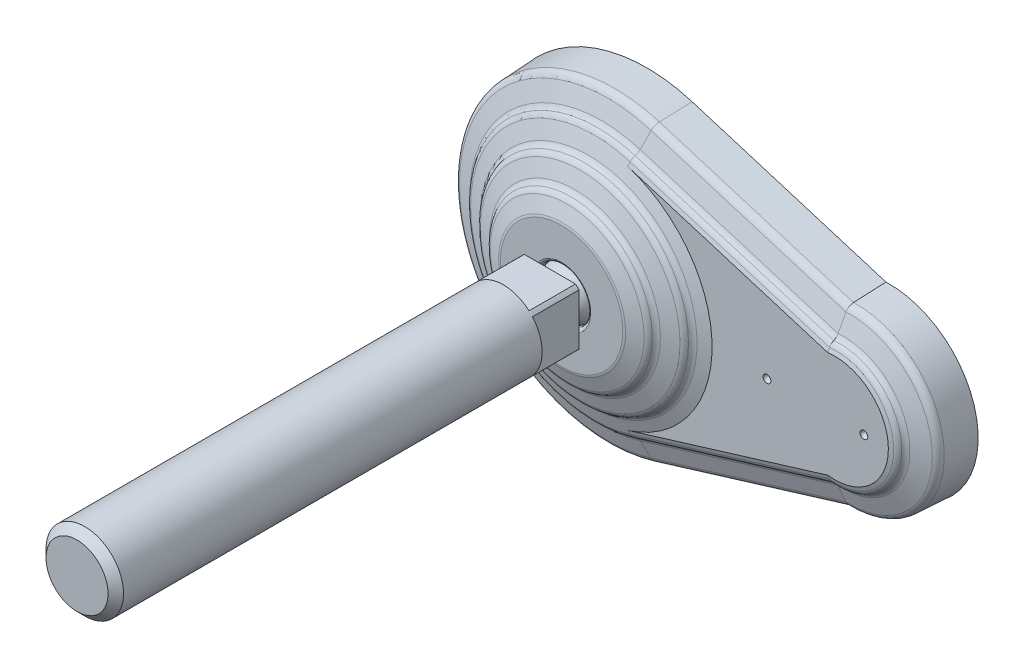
ISO-10303-21;
HEADER;
FILE_DESCRIPTION(('STEP AP214'),'2;1');
FILE_NAME('part.step','',(''),(''),'','','');
FILE_SCHEMA(('AUTOMOTIVE_DESIGN { 1 0 10303 214 1 1 1 1 }'));
ENDSEC;
DATA;
#1=APPLICATION_CONTEXT('core data for automotive mechanical design processes');
#2=APPLICATION_PROTOCOL_DEFINITION('international standard','automotive_design',2000,#1);
#3=PRODUCT_CONTEXT('',#1,'mechanical');
#4=PRODUCT('Part','Part','',(#3));
#5=PRODUCT_RELATED_PRODUCT_CATEGORY('part','',(#4));
#6=PRODUCT_DEFINITION_FORMATION('','',#4);
#7=PRODUCT_DEFINITION_CONTEXT('part definition',#1,'design');
#8=PRODUCT_DEFINITION('design','',#6,#7);
#9=PRODUCT_DEFINITION_SHAPE('','',#8);
#10=(LENGTH_UNIT() NAMED_UNIT(*) SI_UNIT(.MILLI.,.METRE.));
#11=(NAMED_UNIT(*) PLANE_ANGLE_UNIT() SI_UNIT($,.RADIAN.));
#12=(NAMED_UNIT(*) SI_UNIT($,.STERADIAN.) SOLID_ANGLE_UNIT());
#13=UNCERTAINTY_MEASURE_WITH_UNIT(LENGTH_MEASURE(1.E-05),#10,'distance_accuracy_value','');
#14=(GEOMETRIC_REPRESENTATION_CONTEXT(3) GLOBAL_UNCERTAINTY_ASSIGNED_CONTEXT((#13)) GLOBAL_UNIT_ASSIGNED_CONTEXT((#10,
#11,#12)) REPRESENTATION_CONTEXT('',''));
#15=CARTESIAN_POINT('',(0.,0.,0.));
#16=DIRECTION('',(0.,0.,1.));
#17=DIRECTION('',(1.,0.,0.));
#18=AXIS2_PLACEMENT_3D('',#15,#16,#17);
#19=CARTESIAN_POINT('',(0.,0.,39.));
#20=DIRECTION('',(0.,0.,1.));
#21=DIRECTION('',(-1.,0.,0.));
#22=AXIS2_PLACEMENT_3D('',#19,#20,#21);
#23=CYLINDRICAL_SURFACE('',#22,10.);
#24=CARTESIAN_POINT('',(0.,0.,147.));
#25=DIRECTION('',(0.,0.,1.));
#26=DIRECTION('',(-1.,0.,0.));
#27=AXIS2_PLACEMENT_3D('',#24,#25,#26);
#28=CIRCLE('',#27,10.);
#29=CARTESIAN_POINT('',(-10.,0.,147.));
#30=VERTEX_POINT('',#29);
#31=EDGE_CURVE('E9',#30,#30,#28,.F.);
#32=ORIENTED_EDGE('',*,*,#31,.T.);
#33=EDGE_LOOP('',(#32));
#34=FACE_BOUND('',#33,.T.);
#35=DIRECTION('',(0.,0.,1.));
#36=VECTOR('',#35,1.);
#37=CARTESIAN_POINT('',(-6.61437827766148,-7.5,39.));
#38=LINE('',#37,#36);
#39=CARTESIAN_POINT('',(-6.61437827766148,-7.5,39.));
#40=VERTEX_POINT('',#39);
#41=CARTESIAN_POINT('',(-6.61437827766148,-7.5,27.));
#42=VERTEX_POINT('',#41);
#43=EDGE_CURVE('E159',#40,#42,#38,.F.);
#44=ORIENTED_EDGE('',*,*,#43,.F.);
#45=CARTESIAN_POINT('',(0.,0.,39.));
#46=DIRECTION('',(0.,0.,1.));
#47=DIRECTION('',(0.,-1.,0.));
#48=AXIS2_PLACEMENT_3D('',#45,#46,#47);
#49=CIRCLE('',#48,10.);
#50=CARTESIAN_POINT('',(6.61437827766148,-7.5,39.));
#51=VERTEX_POINT('',#50);
#52=EDGE_CURVE('E805',#40,#51,#49,.T.);
#53=ORIENTED_EDGE('',*,*,#52,.T.);
#54=DIRECTION('',(0.,0.,1.));
#55=VECTOR('',#54,1.);
#56=CARTESIAN_POINT('',(6.61437827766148,-7.5,39.));
#57=LINE('',#56,#55);
#58=CARTESIAN_POINT('',(6.61437827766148,-7.5,27.));
#59=VERTEX_POINT('',#58);
#60=EDGE_CURVE('E224',#59,#51,#57,.T.);
#61=ORIENTED_EDGE('',*,*,#60,.F.);
#62=CARTESIAN_POINT('',(0.,0.,27.));
#63=DIRECTION('',(0.,0.,1.));
#64=DIRECTION('',(-1.,0.,0.));
#65=AXIS2_PLACEMENT_3D('',#62,#63,#64);
#66=CIRCLE('',#65,10.);
#67=CARTESIAN_POINT('',(7.5,-6.61437827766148,27.));
#68=VERTEX_POINT('',#67);
#69=EDGE_CURVE('E207',#59,#68,#66,.T.);
#70=ORIENTED_EDGE('',*,*,#69,.T.);
#71=DIRECTION('',(0.,0.,1.));
#72=VECTOR('',#71,1.);
#73=CARTESIAN_POINT('',(7.5,-6.61437827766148,39.));
#74=LINE('',#73,#72);
#75=CARTESIAN_POINT('',(7.5,-6.61437827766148,39.));
#76=VERTEX_POINT('',#75);
#77=EDGE_CURVE('E221',#76,#68,#74,.F.);
#78=ORIENTED_EDGE('',*,*,#77,.F.);
#79=CARTESIAN_POINT('',(7.5,6.61437827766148,39.));
#80=VERTEX_POINT('',#79);
#81=EDGE_CURVE('E301',#76,#80,#49,.T.);
#82=ORIENTED_EDGE('',*,*,#81,.T.);
#83=DIRECTION('',(0.,0.,1.));
#84=VECTOR('',#83,1.);
#85=CARTESIAN_POINT('',(7.5,6.61437827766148,39.));
#86=LINE('',#85,#84);
#87=CARTESIAN_POINT('',(7.5,6.61437827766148,27.));
#88=VERTEX_POINT('',#87);
#89=EDGE_CURVE('E266',#88,#80,#86,.T.);
#90=ORIENTED_EDGE('',*,*,#89,.F.);
#91=CARTESIAN_POINT('',(6.61437827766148,7.5,27.));
#92=VERTEX_POINT('',#91);
#93=EDGE_CURVE('E203',#88,#92,#66,.T.);
#94=ORIENTED_EDGE('',*,*,#93,.T.);
#95=DIRECTION('',(0.,0.,1.));
#96=VECTOR('',#95,1.);
#97=CARTESIAN_POINT('',(6.61437827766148,7.5,39.));
#98=LINE('',#97,#96);
#99=CARTESIAN_POINT('',(6.61437827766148,7.5,39.));
#100=VERTEX_POINT('',#99);
#101=EDGE_CURVE('E184',#100,#92,#98,.F.);
#102=ORIENTED_EDGE('',*,*,#101,.F.);
#103=CARTESIAN_POINT('',(-6.61437827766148,7.5,39.));
#104=VERTEX_POINT('',#103);
#105=EDGE_CURVE('E197',#100,#104,#49,.T.);
#106=ORIENTED_EDGE('',*,*,#105,.T.);
#107=DIRECTION('',(0.,0.,1.));
#108=VECTOR('',#107,1.);
#109=CARTESIAN_POINT('',(-6.61437827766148,7.5,39.));
#110=LINE('',#109,#108);
#111=CARTESIAN_POINT('',(-6.61437827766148,7.5,27.));
#112=VERTEX_POINT('',#111);
#113=EDGE_CURVE('E182',#112,#104,#110,.T.);
#114=ORIENTED_EDGE('',*,*,#113,.F.);
#115=CARTESIAN_POINT('',(-7.5,6.61437827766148,27.));
#116=VERTEX_POINT('',#115);
#117=EDGE_CURVE('E195',#112,#116,#66,.T.);
#118=ORIENTED_EDGE('',*,*,#117,.T.);
#119=DIRECTION('',(0.,0.,1.));
#120=VECTOR('',#119,1.);
#121=CARTESIAN_POINT('',(-7.5,6.61437827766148,39.));
#122=LINE('',#121,#120);
#123=CARTESIAN_POINT('',(-7.5,6.61437827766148,39.));
#124=VERTEX_POINT('',#123);
#125=EDGE_CURVE('E198',#124,#116,#122,.F.);
#126=ORIENTED_EDGE('',*,*,#125,.F.);
#127=CARTESIAN_POINT('',(-7.5,-6.61437827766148,39.));
#128=VERTEX_POINT('',#127);
#129=EDGE_CURVE('E806',#124,#128,#49,.T.);
#130=ORIENTED_EDGE('',*,*,#129,.T.);
#131=DIRECTION('',(0.,0.,1.));
#132=VECTOR('',#131,1.);
#133=CARTESIAN_POINT('',(-7.5,-6.61437827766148,39.));
#134=LINE('',#133,#132);
#135=CARTESIAN_POINT('',(-7.5,-6.61437827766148,27.));
#136=VERTEX_POINT('',#135);
#137=EDGE_CURVE('E204',#136,#128,#134,.T.);
#138=ORIENTED_EDGE('',*,*,#137,.F.);
#139=EDGE_CURVE('E206',#136,#42,#66,.T.);
#140=ORIENTED_EDGE('',*,*,#139,.T.);
#141=EDGE_LOOP('',(#44,#53,#61,#70,#78,#82,#90,#94,#102,#106,#114,#118,#126,#130,#138,#140));
#142=FACE_BOUND('',#141,.T.);
#143=ADVANCED_FACE('F15',(#34,#142),#23,.T.);
#144=CARTESIAN_POINT('',(-5.26544933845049,0.,27.));
#145=DIRECTION('',(0.,0.,1.));
#146=DIRECTION('',(-1.,0.,0.));
#147=AXIS2_PLACEMENT_3D('',#144,#145,#146);
#148=PLANE('',#147);
#149=DIRECTION('',(0.,-1.,0.));
#150=VECTOR('',#149,1.);
#151=CARTESIAN_POINT('',(-7.5,7.5,27.));
#152=LINE('',#151,#150);
#153=EDGE_CURVE('E32',#116,#136,#152,.T.);
#154=ORIENTED_EDGE('',*,*,#153,.F.);
#155=ORIENTED_EDGE('',*,*,#117,.F.);
#156=DIRECTION('',(-1.,0.,0.));
#157=VECTOR('',#156,1.);
#158=CARTESIAN_POINT('',(7.5,7.5,27.));
#159=LINE('',#158,#157);
#160=EDGE_CURVE('E177',#92,#112,#159,.T.);
#161=ORIENTED_EDGE('',*,*,#160,.F.);
#162=ORIENTED_EDGE('',*,*,#93,.F.);
#163=DIRECTION('',(0.,1.,0.));
#164=VECTOR('',#163,1.);
#165=CARTESIAN_POINT('',(7.5,-7.5,27.));
#166=LINE('',#165,#164);
#167=EDGE_CURVE('E189',#68,#88,#166,.T.);
#168=ORIENTED_EDGE('',*,*,#167,.F.);
#169=ORIENTED_EDGE('',*,*,#69,.F.);
#170=DIRECTION('',(1.,0.,0.));
#171=VECTOR('',#170,1.);
#172=CARTESIAN_POINT('',(-7.5,-7.5,27.));
#173=LINE('',#172,#171);
#174=EDGE_CURVE('E226',#42,#59,#173,.T.);
#175=ORIENTED_EDGE('',*,*,#174,.F.);
#176=ORIENTED_EDGE('',*,*,#139,.F.);
#177=EDGE_LOOP('',(#154,#155,#161,#162,#168,#169,#175,#176));
#178=FACE_BOUND('',#177,.T.);
#179=CARTESIAN_POINT('',(0.,0.,27.));
#180=DIRECTION('',(0.,0.,1.));
#181=DIRECTION('',(-1.,0.,0.));
#182=AXIS2_PLACEMENT_3D('',#179,#180,#181);
#183=CIRCLE('',#182,5.26544933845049);
#184=CARTESIAN_POINT('',(-5.26544933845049,0.,27.));
#185=VERTEX_POINT('',#184);
#186=EDGE_CURVE('E212',#185,#185,#183,.T.);
#187=ORIENTED_EDGE('',*,*,#186,.T.);
#188=EDGE_LOOP('',(#187));
#189=FACE_BOUND('',#188,.T.);
#190=ADVANCED_FACE('F200',(#178,#189),#148,.F.);
#191=CARTESIAN_POINT('',(0.,0.,20.6509999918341));
#192=DIRECTION('',(0.,0.,1.));
#193=DIRECTION('',(-1.,0.,0.));
#194=AXIS2_PLACEMENT_3D('',#191,#192,#193);
#195=DEGENERATE_TOROIDAL_SURFACE('',#194,0.000333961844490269,6.829,.T.);
#196=CARTESIAN_POINT('',(0.,0.,21.794));
#197=DIRECTION('',(0.,0.,-1.));
#198=DIRECTION('',(1.,0.,0.));
#199=AXIS2_PLACEMENT_3D('',#196,#197,#198);
#200=CIRCLE('',#199,6.733);
#201=CARTESIAN_POINT('',(6.733,0.,21.794));
#202=VERTEX_POINT('',#201);
#203=EDGE_CURVE('E273',#202,#202,#200,.T.);
#204=ORIENTED_EDGE('',*,*,#203,.F.);
#205=EDGE_LOOP('',(#204));
#206=FACE_BOUND('',#205,.T.);
#207=CARTESIAN_POINT('',(0.,0.,25.));
#208=DIRECTION('',(0.,0.,1.));
#209=DIRECTION('',(-1.,0.,0.));
#210=AXIS2_PLACEMENT_3D('',#207,#208,#209);
#211=CIRCLE('',#210,5.26544933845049);
#212=CARTESIAN_POINT('',(-5.26544933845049,0.,25.));
#213=VERTEX_POINT('',#212);
#214=EDGE_CURVE('E214',#213,#213,#211,.T.);
#215=ORIENTED_EDGE('',*,*,#214,.F.);
#216=EDGE_LOOP('',(#215));
#217=FACE_BOUND('',#216,.T.);
#218=ADVANCED_FACE('F512',(#206,#217),#195,.T.);
#219=CARTESIAN_POINT('',(0.,0.,39.));
#220=DIRECTION('',(0.,0.,1.));
#221=DIRECTION('',(-1.,0.,0.));
#222=AXIS2_PLACEMENT_3D('',#219,#220,#221);
#223=CYLINDRICAL_SURFACE('',#222,5.26544933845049);
#224=ORIENTED_EDGE('',*,*,#186,.F.);
#225=EDGE_LOOP('',(#224));
#226=FACE_BOUND('',#225,.T.);
#227=ORIENTED_EDGE('',*,*,#214,.T.);
#228=EDGE_LOOP('',(#227));
#229=FACE_BOUND('',#228,.T.);
#230=ADVANCED_FACE('F780',(#226,#229),#223,.T.);
#231=CARTESIAN_POINT('',(-7.5,-7.5,27.));
#232=DIRECTION('',(0.,-1.,0.));
#233=DIRECTION('',(1.,0.,0.));
#234=AXIS2_PLACEMENT_3D('',#231,#232,#233);
#235=PLANE('',#234);
#236=ORIENTED_EDGE('',*,*,#60,.T.);
#237=DIRECTION('',(-1.,0.,0.));
#238=VECTOR('',#237,1.);
#239=CARTESIAN_POINT('',(-10.,-7.5,39.));
#240=LINE('',#239,#238);
#241=EDGE_CURVE('E238',#51,#40,#240,.T.);
#242=ORIENTED_EDGE('',*,*,#241,.T.);
#243=ORIENTED_EDGE('',*,*,#43,.T.);
#244=ORIENTED_EDGE('',*,*,#174,.T.);
#245=EDGE_LOOP('',(#236,#242,#243,#244));
#246=FACE_BOUND('',#245,.T.);
#247=ADVANCED_FACE('F778',(#246),#235,.T.);
#248=CARTESIAN_POINT('',(7.5,-7.5,27.));
#249=DIRECTION('',(1.,0.,0.));
#250=DIRECTION('',(0.,1.,0.));
#251=AXIS2_PLACEMENT_3D('',#248,#249,#250);
#252=PLANE('',#251);
#253=ORIENTED_EDGE('',*,*,#89,.T.);
#254=DIRECTION('',(0.,-1.,0.));
#255=VECTOR('',#254,1.);
#256=CARTESIAN_POINT('',(7.5,0.,39.));
#257=LINE('',#256,#255);
#258=EDGE_CURVE('E245',#80,#76,#257,.T.);
#259=ORIENTED_EDGE('',*,*,#258,.T.);
#260=ORIENTED_EDGE('',*,*,#77,.T.);
#261=ORIENTED_EDGE('',*,*,#167,.T.);
#262=EDGE_LOOP('',(#253,#259,#260,#261));
#263=FACE_BOUND('',#262,.T.);
#264=ADVANCED_FACE('F774',(#263),#252,.T.);
#265=CARTESIAN_POINT('',(7.5,7.5,27.));
#266=DIRECTION('',(0.,1.,0.));
#267=DIRECTION('',(-1.,0.,0.));
#268=AXIS2_PLACEMENT_3D('',#265,#266,#267);
#269=PLANE('',#268);
#270=ORIENTED_EDGE('',*,*,#113,.T.);
#271=DIRECTION('',(1.,0.,0.));
#272=VECTOR('',#271,1.);
#273=CARTESIAN_POINT('',(-10.,7.5,39.));
#274=LINE('',#273,#272);
#275=EDGE_CURVE('E249',#104,#100,#274,.T.);
#276=ORIENTED_EDGE('',*,*,#275,.T.);
#277=ORIENTED_EDGE('',*,*,#101,.T.);
#278=ORIENTED_EDGE('',*,*,#160,.T.);
#279=EDGE_LOOP('',(#270,#276,#277,#278));
#280=FACE_BOUND('',#279,.T.);
#281=ADVANCED_FACE('F179',(#280),#269,.T.);
#282=CARTESIAN_POINT('',(-7.5,7.5,27.));
#283=DIRECTION('',(-1.,0.,0.));
#284=DIRECTION('',(0.,-1.,0.));
#285=AXIS2_PLACEMENT_3D('',#282,#283,#284);
#286=PLANE('',#285);
#287=ORIENTED_EDGE('',*,*,#137,.T.);
#288=DIRECTION('',(0.,1.,0.));
#289=VECTOR('',#288,1.);
#290=CARTESIAN_POINT('',(-7.5,0.,39.));
#291=LINE('',#290,#289);
#292=EDGE_CURVE('E262',#128,#124,#291,.T.);
#293=ORIENTED_EDGE('',*,*,#292,.T.);
#294=ORIENTED_EDGE('',*,*,#125,.T.);
#295=ORIENTED_EDGE('',*,*,#153,.T.);
#296=EDGE_LOOP('',(#287,#293,#294,#295));
#297=FACE_BOUND('',#296,.T.);
#298=ADVANCED_FACE('F754',(#297),#286,.T.);
#299=CARTESIAN_POINT('',(0.,0.,0.));
#300=DIRECTION('',(0.,0.,1.));
#301=DIRECTION('',(0.,-1.,0.));
#302=AXIS2_PLACEMENT_3D('',#299,#300,#301);
#303=PLANE('',#302);
#304=DIRECTION('',(-0.951485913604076,0.307692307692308,0.));
#305=VECTOR('',#304,1.);
#306=CARTESIAN_POINT('',(69.9230769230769,15.2237746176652,0.));
#307=LINE('',#306,#305);
#308=CARTESIAN_POINT('',(69.9230769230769,15.2237746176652,0.));
#309=VERTEX_POINT('',#308);
#310=CARTESIAN_POINT('',(11.0769230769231,34.2534928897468,0.));
#311=VERTEX_POINT('',#310);
#312=EDGE_CURVE('E285',#309,#311,#307,.T.);
#313=ORIENTED_EDGE('',*,*,#312,.F.);
#314=CARTESIAN_POINT('',(65.,0.,0.));
#315=DIRECTION('',(0.,0.,1.));
#316=DIRECTION('',(1.,0.,0.));
#317=AXIS2_PLACEMENT_3D('',#314,#315,#316);
#318=CIRCLE('',#317,16.);
#319=CARTESIAN_POINT('',(69.9230769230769,-15.2237746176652,0.));
#320=VERTEX_POINT('',#319);
#321=EDGE_CURVE('E295',#320,#309,#318,.T.);
#322=ORIENTED_EDGE('',*,*,#321,.F.);
#323=DIRECTION('',(0.951485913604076,0.307692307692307,0.));
#324=VECTOR('',#323,1.);
#325=CARTESIAN_POINT('',(11.0769230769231,-34.2534928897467,0.));
#326=LINE('',#325,#324);
#327=CARTESIAN_POINT('',(11.0769230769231,-34.2534928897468,0.));
#328=VERTEX_POINT('',#327);
#329=EDGE_CURVE('E292',#328,#320,#326,.T.);
#330=ORIENTED_EDGE('',*,*,#329,.F.);
#331=CARTESIAN_POINT('',(0.,0.,0.));
#332=DIRECTION('',(0.,0.,1.));
#333=DIRECTION('',(1.,0.,0.));
#334=AXIS2_PLACEMENT_3D('',#331,#332,#333);
#335=CIRCLE('',#334,36.);
#336=EDGE_CURVE('E288',#311,#328,#335,.T.);
#337=ORIENTED_EDGE('',*,*,#336,.F.);
#338=EDGE_LOOP('',(#313,#322,#330,#337));
#339=FACE_BOUND('',#338,.T.);
#340=ADVANCED_FACE('F514',(#339),#303,.F.);
#341=CARTESIAN_POINT('',(11.0769230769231,-34.2534928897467,0.));
#342=DIRECTION('',(0.307692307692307,-0.951485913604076,0.));
#343=DIRECTION('',(0.951485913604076,0.307692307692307,0.));
#344=AXIS2_PLACEMENT_3D('',#341,#342,#343);
#345=PLANE('',#344);
#346=DIRECTION('',(0.951485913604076,0.307692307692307,0.));
#347=VECTOR('',#346,1.);
#348=CARTESIAN_POINT('',(11.0769230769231,-34.2534928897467,2.));
#349=LINE('',#348,#347);
#350=CARTESIAN_POINT('',(11.0769230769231,-34.2534928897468,2.));
#351=VERTEX_POINT('',#350);
#352=CARTESIAN_POINT('',(69.9230769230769,-15.2237746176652,2.));
#353=VERTEX_POINT('',#352);
#354=EDGE_CURVE('E304',#351,#353,#349,.T.);
#355=ORIENTED_EDGE('',*,*,#354,.F.);
#356=DIRECTION('',(0.,0.,1.));
#357=VECTOR('',#356,1.);
#358=CARTESIAN_POINT('',(11.0769230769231,-34.2534928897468,0.));
#359=LINE('',#358,#357);
#360=EDGE_CURVE('E312',#328,#351,#359,.T.);
#361=ORIENTED_EDGE('',*,*,#360,.F.);
#362=ORIENTED_EDGE('',*,*,#329,.T.);
#363=DIRECTION('',(0.,0.,1.));
#364=VECTOR('',#363,1.);
#365=CARTESIAN_POINT('',(69.9230769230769,-15.2237746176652,0.));
#366=LINE('',#365,#364);
#367=EDGE_CURVE('E310',#320,#353,#366,.T.);
#368=ORIENTED_EDGE('',*,*,#367,.T.);
#369=EDGE_LOOP('',(#355,#361,#362,#368));
#370=FACE_BOUND('',#369,.T.);
#371=ADVANCED_FACE('F771',(#370),#345,.T.);
#372=CARTESIAN_POINT('',(0.,0.,0.));
#373=DIRECTION('',(0.,0.,1.));
#374=DIRECTION('',(0.,-1.,0.));
#375=AXIS2_PLACEMENT_3D('',#372,#373,#374);
#376=CYLINDRICAL_SURFACE('',#375,36.);
#377=CARTESIAN_POINT('',(0.,0.,2.));
#378=DIRECTION('',(0.,0.,1.));
#379=DIRECTION('',(1.,0.,0.));
#380=AXIS2_PLACEMENT_3D('',#377,#378,#379);
#381=CIRCLE('',#380,36.);
#382=CARTESIAN_POINT('',(11.0769230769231,34.2534928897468,2.));
#383=VERTEX_POINT('',#382);
#384=EDGE_CURVE('E300',#383,#351,#381,.T.);
#385=ORIENTED_EDGE('',*,*,#384,.F.);
#386=DIRECTION('',(0.,0.,1.));
#387=VECTOR('',#386,1.);
#388=CARTESIAN_POINT('',(11.0769230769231,34.2534928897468,0.));
#389=LINE('',#388,#387);
#390=EDGE_CURVE('E314',#311,#383,#389,.T.);
#391=ORIENTED_EDGE('',*,*,#390,.F.);
#392=ORIENTED_EDGE('',*,*,#336,.T.);
#393=ORIENTED_EDGE('',*,*,#360,.T.);
#394=EDGE_LOOP('',(#385,#391,#392,#393));
#395=FACE_BOUND('',#394,.T.);
#396=ADVANCED_FACE('F1138',(#395),#376,.T.);
#397=CARTESIAN_POINT('',(69.9230769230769,15.2237746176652,0.));
#398=DIRECTION('',(0.307692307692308,0.951485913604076,0.));
#399=DIRECTION('',(-0.951485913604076,0.307692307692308,0.));
#400=AXIS2_PLACEMENT_3D('',#397,#398,#399);
#401=PLANE('',#400);
#402=DIRECTION('',(-0.951485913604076,0.307692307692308,0.));
#403=VECTOR('',#402,1.);
#404=CARTESIAN_POINT('',(69.9230769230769,15.2237746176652,2.));
#405=LINE('',#404,#403);
#406=CARTESIAN_POINT('',(69.9230769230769,15.2237746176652,2.));
#407=VERTEX_POINT('',#406);
#408=EDGE_CURVE('E150',#407,#383,#405,.T.);
#409=ORIENTED_EDGE('',*,*,#408,.F.);
#410=DIRECTION('',(0.,0.,1.));
#411=VECTOR('',#410,1.);
#412=CARTESIAN_POINT('',(69.9230769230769,15.2237746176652,0.));
#413=LINE('',#412,#411);
#414=EDGE_CURVE('E298',#309,#407,#413,.T.);
#415=ORIENTED_EDGE('',*,*,#414,.F.);
#416=ORIENTED_EDGE('',*,*,#312,.T.);
#417=ORIENTED_EDGE('',*,*,#390,.T.);
#418=EDGE_LOOP('',(#409,#415,#416,#417));
#419=FACE_BOUND('',#418,.T.);
#420=ADVANCED_FACE('F538',(#419),#401,.T.);
#421=CARTESIAN_POINT('',(65.,0.,0.));
#422=DIRECTION('',(0.,0.,1.));
#423=DIRECTION('',(0.,-1.,0.));
#424=AXIS2_PLACEMENT_3D('',#421,#422,#423);
#425=CYLINDRICAL_SURFACE('',#424,16.);
#426=CARTESIAN_POINT('',(65.,0.,2.));
#427=DIRECTION('',(0.,0.,1.));
#428=DIRECTION('',(1.,0.,0.));
#429=AXIS2_PLACEMENT_3D('',#426,#427,#428);
#430=CIRCLE('',#429,16.);
#431=EDGE_CURVE('E289',#353,#407,#430,.T.);
#432=ORIENTED_EDGE('',*,*,#431,.F.);
#433=ORIENTED_EDGE('',*,*,#367,.F.);
#434=ORIENTED_EDGE('',*,*,#321,.T.);
#435=ORIENTED_EDGE('',*,*,#414,.T.);
#436=EDGE_LOOP('',(#432,#433,#434,#435));
#437=FACE_BOUND('',#436,.T.);
#438=ADVANCED_FACE('F523',(#437),#425,.T.);
#439=CARTESIAN_POINT('',(62.5,0.,2.));
#440=DIRECTION('',(0.,0.,-1.));
#441=DIRECTION('',(0.,1.,0.));
#442=AXIS2_PLACEMENT_3D('',#439,#440,#441);
#443=CONICAL_SURFACE('',#442,22.9787234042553,0.0523365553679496);
#444=CARTESIAN_POINT('',(62.5,0.,10.3041173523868));
#445=DIRECTION('',(0.,0.,1.));
#446=DIRECTION('',(0.,-1.,0.));
#447=AXIS2_PLACEMENT_3D('',#444,#445,#446);
#448=CIRCLE('',#447,22.5437172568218);
#449=CARTESIAN_POINT('',(61.6407011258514,-22.5273343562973,10.3041173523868));
#450=VERTEX_POINT('',#449);
#451=CARTESIAN_POINT('',(61.6407011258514,22.5273343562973,10.3041173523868));
#452=VERTEX_POINT('',#451);
#453=EDGE_CURVE('E344',#450,#452,#448,.T.);
#454=ORIENTED_EDGE('',*,*,#453,.F.);
#455=CARTESIAN_POINT('',(61.6406997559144,-22.5273238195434,10.3043173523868));
#456=CARTESIAN_POINT('',(61.6501805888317,-22.600242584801,8.92023165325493));
#457=CARTESIAN_POINT('',(61.6596900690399,-22.6731526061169,7.53614569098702));
#458=CARTESIAN_POINT('',(61.6787663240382,-22.8189551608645,4.76797324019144));
#459=CARTESIAN_POINT('',(61.6883330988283,-22.8918476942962,3.38388675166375));
#460=CARTESIAN_POINT('',(61.6979285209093,-22.9647314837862,1.9998));
#461=B_SPLINE_CURVE_WITH_KNOTS('',3,(#455,#456,#457,#458,#459,#460),.UNSPECIFIED.,.F.,.F.,(4,2,
4),(0.,4.15811282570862,8.31622565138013),.UNSPECIFIED.);
#462=CARTESIAN_POINT('',(61.697927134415,-22.9647209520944,2.));
#463=VERTEX_POINT('',#462);
#464=EDGE_CURVE('E651',#450,#463,#461,.T.);
#465=ORIENTED_EDGE('',*,*,#464,.T.);
#466=CARTESIAN_POINT('',(62.5,0.,2.));
#467=DIRECTION('',(0.,0.,1.));
#468=DIRECTION('',(0.,-1.,0.));
#469=AXIS2_PLACEMENT_3D('',#466,#467,#468);
#470=CIRCLE('',#469,22.9787234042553);
#471=CARTESIAN_POINT('',(61.6979271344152,22.9647209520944,2.));
#472=VERTEX_POINT('',#471);
#473=EDGE_CURVE('E346',#463,#472,#470,.T.);
#474=ORIENTED_EDGE('',*,*,#473,.T.);
#475=CARTESIAN_POINT('',(61.6979285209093,22.9647314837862,1.9998));
#476=CARTESIAN_POINT('',(61.6883330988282,22.8918476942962,3.38388675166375));
#477=CARTESIAN_POINT('',(61.6787663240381,22.8189551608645,4.76797324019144));
#478=CARTESIAN_POINT('',(61.6596900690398,22.6731526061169,7.53614569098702));
#479=CARTESIAN_POINT('',(61.6501805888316,22.600242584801,8.92023165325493));
#480=CARTESIAN_POINT('',(61.6406997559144,22.5273238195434,10.3043173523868));
#481=B_SPLINE_CURVE_WITH_KNOTS('',3,(#475,#476,#477,#478,#479,#480),.UNSPECIFIED.,.F.,.F.,(4,2,
4),(0.,4.15811282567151,8.31622565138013),.UNSPECIFIED.);
#482=EDGE_CURVE('E697',#472,#452,#481,.T.);
#483=ORIENTED_EDGE('',*,*,#482,.T.);
#484=EDGE_LOOP('',(#454,#465,#474,#483));
#485=FACE_BOUND('',#484,.T.);
#486=ADVANCED_FACE('F517',(#485),#443,.T.);
#487=CARTESIAN_POINT('',(64.1644462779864,-21.755748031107,10.3041173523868));
#488=DIRECTION('',(-0.291971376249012,0.9549953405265,-0.0523126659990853));
#489=DIRECTION('',(-0.956304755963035,-0.292371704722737,0.));
#490=AXIS2_PLACEMENT_3D('',#487,#488,#489);
#491=PLANE('',#490);
#492=ORIENTED_EDGE('',*,*,#464,.F.);
#493=DIRECTION('',(-0.956304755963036,-0.292371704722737,0.));
#494=VECTOR('',#493,1.);
#495=CARTESIAN_POINT('',(64.1644462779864,-21.755748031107,10.3041173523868));
#496=LINE('',#495,#494);
#497=CARTESIAN_POINT('',(11.5676847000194,-37.8361917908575,10.3041173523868));
#498=VERTEX_POINT('',#497);
#499=EDGE_CURVE('E600',#450,#498,#496,.T.);
#500=ORIENTED_EDGE('',*,*,#499,.T.);
#501=DIRECTION('',(-0.0152947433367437,0.050026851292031,0.998630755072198));
#502=VECTOR('',#501,1.);
#503=CARTESIAN_POINT('',(11.6948681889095,-38.2521902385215,2.));
#504=LINE('',#503,#502);
#505=CARTESIAN_POINT('',(11.6948681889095,-38.2521902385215,2.));
#506=VERTEX_POINT('',#505);
#507=EDGE_CURVE('E606',#506,#498,#504,.T.);
#508=ORIENTED_EDGE('',*,*,#507,.F.);
#509=DIRECTION('',(-0.956304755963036,-0.292371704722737,0.));
#510=VECTOR('',#509,1.);
#511=CARTESIAN_POINT('',(64.2916297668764,-22.1717464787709,2.));
#512=LINE('',#511,#510);
#513=EDGE_CURVE('E144',#463,#506,#512,.T.);
#514=ORIENTED_EDGE('',*,*,#513,.F.);
#515=EDGE_LOOP('',(#492,#500,#508,#514));
#516=FACE_BOUND('',#515,.T.);
#517=ADVANCED_FACE('F508',(#516),#491,.F.);
#518=CARTESIAN_POINT('',(0.,0.,2.));
#519=DIRECTION('',(0.,0.,1.));
#520=DIRECTION('',(-1.,0.,0.));
#521=AXIS2_PLACEMENT_3D('',#518,#519,#520);
#522=PLANE('',#521);
#523=DIRECTION('',(-0.956304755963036,0.292371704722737,0.));
#524=VECTOR('',#523,1.);
#525=CARTESIAN_POINT('',(64.2916297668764,22.1717464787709,2.));
#526=LINE('',#525,#524);
#527=CARTESIAN_POINT('',(11.6948681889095,38.2521902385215,2.));
#528=VERTEX_POINT('',#527);
#529=EDGE_CURVE('E653',#472,#528,#526,.T.);
#530=ORIENTED_EDGE('',*,*,#529,.F.);
#531=ORIENTED_EDGE('',*,*,#473,.F.);
#532=ORIENTED_EDGE('',*,*,#513,.T.);
#533=CARTESIAN_POINT('',(0.,0.,2.));
#534=DIRECTION('',(0.,0.,1.));
#535=DIRECTION('',(-1.,0.,0.));
#536=AXIS2_PLACEMENT_3D('',#533,#534,#535);
#537=CIRCLE('',#536,40.);
#538=EDGE_CURVE('E389',#528,#506,#537,.T.);
#539=ORIENTED_EDGE('',*,*,#538,.F.);
#540=EDGE_LOOP('',(#530,#531,#532,#539));
#541=FACE_BOUND('',#540,.T.);
#542=ORIENTED_EDGE('',*,*,#431,.T.);
#543=ORIENTED_EDGE('',*,*,#408,.T.);
#544=ORIENTED_EDGE('',*,*,#384,.T.);
#545=ORIENTED_EDGE('',*,*,#354,.T.);
#546=EDGE_LOOP('',(#542,#543,#544,#545));
#547=FACE_BOUND('',#546,.T.);
#548=ADVANCED_FACE('F398',(#541,#547),#522,.F.);
#549=CARTESIAN_POINT('',(64.2916297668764,22.1717464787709,2.));
#550=DIRECTION('',(-0.291971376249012,-0.9549953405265,-0.0523126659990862));
#551=DIRECTION('',(0.956304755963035,-0.292371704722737,0.));
#552=AXIS2_PLACEMENT_3D('',#549,#550,#551);
#553=PLANE('',#552);
#554=ORIENTED_EDGE('',*,*,#482,.F.);
#555=ORIENTED_EDGE('',*,*,#529,.T.);
#556=DIRECTION('',(-0.0152947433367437,-0.050026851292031,0.998630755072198));
#557=VECTOR('',#556,1.);
#558=CARTESIAN_POINT('',(11.6948681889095,38.2521902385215,2.));
#559=LINE('',#558,#557);
#560=CARTESIAN_POINT('',(11.5676847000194,37.8361917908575,10.3041173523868));
#561=VERTEX_POINT('',#560);
#562=EDGE_CURVE('E620',#528,#561,#559,.T.);
#563=ORIENTED_EDGE('',*,*,#562,.T.);
#564=DIRECTION('',(-0.956304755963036,0.292371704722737,0.));
#565=VECTOR('',#564,1.);
#566=CARTESIAN_POINT('',(64.1644462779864,21.755748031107,10.3041173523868));
#567=LINE('',#566,#565);
#568=EDGE_CURVE('E654',#452,#561,#567,.T.);
#569=ORIENTED_EDGE('',*,*,#568,.F.);
#570=EDGE_LOOP('',(#554,#555,#563,#569));
#571=FACE_BOUND('',#570,.T.);
#572=ADVANCED_FACE('F478',(#571),#553,.F.);
#573=CARTESIAN_POINT('',(62.5,0.,10.1991258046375));
#574=DIRECTION('',(0.,0.,1.));
#575=DIRECTION('',(0.,-1.,0.));
#576=AXIS2_PLACEMENT_3D('',#573,#574,#575);
#577=TOROIDAL_SURFACE('',#576,20.5394653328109,2.007);
#578=CARTESIAN_POINT('',(61.6407233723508,-22.5275054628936,10.0974340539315));
#579=CARTESIAN_POINT('',(61.6409510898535,-22.5292569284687,10.1317993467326));
#580=CARTESIAN_POINT('',(61.6410635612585,-22.5301219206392,10.1661964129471));
#581=CARTESIAN_POINT('',(61.6410572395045,-22.5300732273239,10.235045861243));
#582=CARTESIAN_POINT('',(61.6409380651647,-22.5291566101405,10.2694982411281));
#583=CARTESIAN_POINT('',(61.6399396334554,-22.5214778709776,10.4153785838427));
#584=CARTESIAN_POINT('',(61.6379561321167,-22.5062239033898,10.526490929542));
#585=CARTESIAN_POINT('',(61.6316126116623,-22.4573679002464,10.7446232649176));
#586=CARTESIAN_POINT('',(61.6272490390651,-22.4237384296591,10.8516368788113));
#587=CARTESIAN_POINT('',(61.6163034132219,-22.339189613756,11.058357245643));
#588=CARTESIAN_POINT('',(61.6097238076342,-22.2882893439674,11.1580719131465));
#589=CARTESIAN_POINT('',(61.5945702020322,-22.1707054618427,11.3475467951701));
#590=CARTESIAN_POINT('',(61.5859960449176,-22.1040206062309,11.4373062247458));
#591=CARTESIAN_POINT('',(61.5670698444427,-21.9562760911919,11.6050783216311));
#592=CARTESIAN_POINT('',(61.5567047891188,-21.8751110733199,11.6829965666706));
#593=CARTESIAN_POINT('',(61.5345911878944,-21.7011851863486,11.8241014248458));
#594=CARTESIAN_POINT('',(61.5228449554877,-21.6084436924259,11.8873121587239));
#595=CARTESIAN_POINT('',(61.5046129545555,-21.4637836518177,11.9692866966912));
#596=CARTESIAN_POINT('',(61.4985079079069,-21.4152343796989,11.9942523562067));
#597=CARTESIAN_POINT('',(61.4860940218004,-21.3162718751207,12.0401972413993));
#598=CARTESIAN_POINT('',(61.4797850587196,-21.2658575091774,12.0611739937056));
#599=CARTESIAN_POINT('',(61.4596293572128,-21.1043762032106,12.1208327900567));
#600=CARTESIAN_POINT('',(61.4454888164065,-20.9904779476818,12.1519983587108));
#601=CARTESIAN_POINT('',(61.4169436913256,-20.7591475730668,12.1941665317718));
#602=CARTESIAN_POINT('',(61.4025394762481,-20.6417202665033,12.2051954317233));
#603=CARTESIAN_POINT('',(61.3876252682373,-20.5193667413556,12.2061070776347));
#604=CARTESIAN_POINT('',(61.3870090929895,-20.5143103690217,12.2061258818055));
#605=CARTESIAN_POINT('',(61.3863931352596,-20.5092543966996,12.2061258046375));
#606=B_SPLINE_CURVE_WITH_KNOTS('',3,(#578,#579,#580,#581,#582,#583,#584,#585,#586,#587,#588,
#589,#590,#591,#592,#593,#594,#595,#596,#597,#598,#599,#600,#601,#602,#603,#604,#605),
.UNSPECIFIED.,.F.,.F.,(4,2,2,2,2,2,2,2,2,2,2,2,2,4),(0.,0.103191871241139,0.20655369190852,
0.541275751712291,0.87649892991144,1.21135305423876,1.54623356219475,1.8836582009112,
2.22052549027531,2.38517216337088,2.54992059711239,2.9048600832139,3.25933573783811,
3.2746170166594),.UNSPECIFIED.);
#607=CARTESIAN_POINT('',(61.4734629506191,-21.2152067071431,12.0798866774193));
#608=VERTEX_POINT('',#607);
#609=EDGE_CURVE('E1245',#450,#608,#606,.T.);
#610=ORIENTED_EDGE('',*,*,#609,.F.);
#611=ORIENTED_EDGE('',*,*,#453,.T.);
#612=CARTESIAN_POINT('',(61.3863931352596,20.5092543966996,12.2061258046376));
#613=CARTESIAN_POINT('',(61.3870091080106,20.5143104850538,12.2061258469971));
#614=CARTESIAN_POINT('',(61.3876252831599,20.5193668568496,12.206107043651));
#615=CARTESIAN_POINT('',(61.3988855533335,20.6117442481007,12.2054193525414));
#616=CARTESIAN_POINT('',(61.4095840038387,20.6991031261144,12.1991511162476));
#617=CARTESIAN_POINT('',(61.4308936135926,20.8723273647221,12.1754412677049));
#618=CARTESIAN_POINT('',(61.4415047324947,20.9581920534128,12.1579947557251));
#619=CARTESIAN_POINT('',(61.4555813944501,21.0716202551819,12.1272225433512));
#620=CARTESIAN_POINT('',(61.4591730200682,21.1005182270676,12.1186877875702));
#621=CARTESIAN_POINT('',(61.4663157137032,21.1579059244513,12.1003430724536));
#622=CARTESIAN_POINT('',(61.4698667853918,21.1863956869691,12.090533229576));
#623=CARTESIAN_POINT('',(61.4866782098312,21.3210820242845,12.0407628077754));
#624=CARTESIAN_POINT('',(61.4996430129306,21.4243838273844,11.9924168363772));
#625=CARTESIAN_POINT('',(61.5245148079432,21.6216549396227,11.8789198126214));
#626=CARTESIAN_POINT('',(61.5364193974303,21.7156031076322,11.8137318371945));
#627=CARTESIAN_POINT('',(61.5587594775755,21.8912250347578,11.6683429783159));
#628=CARTESIAN_POINT('',(61.5691956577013,21.9729045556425,11.5881491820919));
#629=CARTESIAN_POINT('',(61.5882470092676,22.1215501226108,11.4149543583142));
#630=CARTESIAN_POINT('',(61.5968625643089,22.1885192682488,11.3219560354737));
#631=CARTESIAN_POINT('',(61.6119005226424,22.3051440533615,11.1267480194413));
#632=CARTESIAN_POINT('',(61.6183432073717,22.3549598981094,11.0246354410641));
#633=CARTESIAN_POINT('',(61.6289130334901,22.4365717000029,10.8134345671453));
#634=CARTESIAN_POINT('',(61.6330436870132,22.4683949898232,10.704357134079));
#635=CARTESIAN_POINT('',(61.6371976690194,22.5003783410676,10.5457196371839));
#636=CARTESIAN_POINT('',(61.6382205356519,22.5082502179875,10.4976293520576));
#637=CARTESIAN_POINT('',(61.639806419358,22.5204527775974,10.4010313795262));
#638=CARTESIAN_POINT('',(61.6403698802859,22.52478687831,10.3525241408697));
#639=CARTESIAN_POINT('',(61.6411729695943,22.5309631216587,10.2351641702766));
#640=CARTESIAN_POINT('',(61.641181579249,22.5310278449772,10.1662118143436));
#641=CARTESIAN_POINT('',(61.6407233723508,22.5275054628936,10.0974340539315));
#642=B_SPLINE_CURVE_WITH_KNOTS('',3,(#612,#613,#614,#615,#616,#617,#618,#619,#620,#621,#622,
#623,#624,#625,#626,#627,#628,#629,#630,#631,#632,#633,#634,#635,#636,#637,#638,#639,#640,#641),
.UNSPECIFIED.,.F.,.F.,(4,2,2,2,2,2,2,2,2,2,2,2,2,2,4),(0.,0.0152812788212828,0.279174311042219,
0.543183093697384,0.634194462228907,0.725197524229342,1.06775959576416,1.41107914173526,
1.75423694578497,2.09732237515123,2.43711059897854,2.77638125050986,2.92250118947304,
3.06847978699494,3.27496314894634),.UNSPECIFIED.);
#643=CARTESIAN_POINT('',(61.4734629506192,21.2152067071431,12.0798866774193));
#644=VERTEX_POINT('',#643);
#645=EDGE_CURVE('E467',#644,#452,#642,.T.);
#646=ORIENTED_EDGE('',*,*,#645,.F.);
#647=CARTESIAN_POINT('',(62.5,0.,12.0798866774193));
#648=DIRECTION('',(0.,0.,1.));
#649=DIRECTION('',(0.,-1.,0.));
#650=AXIS2_PLACEMENT_3D('',#647,#648,#649);
#651=CIRCLE('',#650,21.2400276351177);
#652=EDGE_CURVE('E342',#608,#644,#651,.T.);
#653=ORIENTED_EDGE('',*,*,#652,.F.);
#654=EDGE_LOOP('',(#610,#611,#646,#653));
#655=FACE_BOUND('',#654,.T.);
#656=ADVANCED_FACE('F449',(#655),#577,.T.);
#657=CARTESIAN_POINT('',(63.5784597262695,-19.8390723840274,10.1991258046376));
#658=DIRECTION('',(-0.956304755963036,-0.292371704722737,0.));
#659=DIRECTION('',(0.292371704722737,-0.956304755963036,0.));
#660=AXIS2_PLACEMENT_3D('',#657,#658,#659);
#661=CYLINDRICAL_SURFACE('',#660,2.00699999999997);
#662=ORIENTED_EDGE('',*,*,#499,.F.);
#663=ORIENTED_EDGE('',*,*,#609,.T.);
#664=DIRECTION('',(-0.956304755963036,-0.292371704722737,0.));
#665=VECTOR('',#664,1.);
#666=CARTESIAN_POINT('',(63.7832843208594,-20.5090234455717,12.0798866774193));
#667=LINE('',#666,#665);
#668=CARTESIAN_POINT('',(11.1865227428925,-36.5894672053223,12.0798866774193));
#669=VERTEX_POINT('',#668);
#670=EDGE_CURVE('E597',#608,#669,#667,.T.);
#671=ORIENTED_EDGE('',*,*,#670,.T.);
#672=CARTESIAN_POINT('',(10.9816981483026,-35.9195161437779,10.1991258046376));
#673=DIRECTION('',(0.956304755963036,0.292371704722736,0.));
#674=DIRECTION('',(-0.292371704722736,0.956304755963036,0.));
#675=AXIS2_PLACEMENT_3D('',#672,#673,#674);
#676=CIRCLE('',#675,2.007);
#677=EDGE_CURVE('E609',#669,#498,#676,.T.);
#678=ORIENTED_EDGE('',*,*,#677,.T.);
#679=EDGE_LOOP('',(#662,#663,#671,#678));
#680=FACE_BOUND('',#679,.T.);
#681=ADVANCED_FACE('F479',(#680),#661,.T.);
#682=CARTESIAN_POINT('',(0.,0.,2.));
#683=DIRECTION('',(0.,0.,-1.));
#684=DIRECTION('',(1.,0.,0.));
#685=AXIS2_PLACEMENT_3D('',#682,#683,#684);
#686=CONICAL_SURFACE('',#685,40.,0.0523365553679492);
#687=CARTESIAN_POINT('',(0.,0.,10.3041173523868));
#688=DIRECTION('',(0.,0.,1.));
#689=DIRECTION('',(-1.,0.,0.));
#690=AXIS2_PLACEMENT_3D('',#687,#688,#689);
#691=CIRCLE('',#690,39.5649938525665);
#692=EDGE_CURVE('E640',#561,#498,#691,.T.);
#693=ORIENTED_EDGE('',*,*,#692,.F.);
#694=ORIENTED_EDGE('',*,*,#562,.F.);
#695=ORIENTED_EDGE('',*,*,#538,.T.);
#696=ORIENTED_EDGE('',*,*,#507,.T.);
#697=EDGE_LOOP('',(#693,#694,#695,#696));
#698=FACE_BOUND('',#697,.T.);
#699=ADVANCED_FACE('F499',(#698),#686,.T.);
#700=CARTESIAN_POINT('',(63.5784597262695,19.8390723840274,10.1991258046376));
#701=DIRECTION('',(-0.956304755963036,0.292371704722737,0.));
#702=DIRECTION('',(-0.292371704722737,-0.956304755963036,0.));
#703=AXIS2_PLACEMENT_3D('',#700,#701,#702);
#704=CYLINDRICAL_SURFACE('',#703,2.00699999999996);
#705=DIRECTION('',(-0.956304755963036,0.292371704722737,0.));
#706=VECTOR('',#705,1.);
#707=CARTESIAN_POINT('',(63.7832843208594,20.5090234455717,12.0798866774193));
#708=LINE('',#707,#706);
#709=CARTESIAN_POINT('',(11.1865227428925,36.5894672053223,12.0798866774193));
#710=VERTEX_POINT('',#709);
#711=EDGE_CURVE('E586',#644,#710,#708,.T.);
#712=ORIENTED_EDGE('',*,*,#711,.F.);
#713=ORIENTED_EDGE('',*,*,#645,.T.);
#714=ORIENTED_EDGE('',*,*,#568,.T.);
#715=CARTESIAN_POINT('',(10.9816981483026,35.9195161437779,10.1991258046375));
#716=DIRECTION('',(-0.956304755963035,0.292371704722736,0.));
#717=DIRECTION('',(-0.292371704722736,-0.956304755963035,0.));
#718=AXIS2_PLACEMENT_3D('',#715,#716,#717);
#719=CIRCLE('',#718,2.007);
#720=EDGE_CURVE('E623',#710,#561,#719,.T.);
#721=ORIENTED_EDGE('',*,*,#720,.F.);
#722=EDGE_LOOP('',(#712,#713,#714,#721));
#723=FACE_BOUND('',#722,.T.);
#724=ADVANCED_FACE('F407',(#723),#704,.T.);
#725=CARTESIAN_POINT('',(62.5,0.,12.0798866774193));
#726=DIRECTION('',(0.,0.,-1.));
#727=DIRECTION('',(0.,1.,0.));
#728=AXIS2_PLACEMENT_3D('',#725,#726,#727);
#729=CONICAL_SURFACE('',#728,21.2400276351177,1.21422909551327);
#730=CARTESIAN_POINT('',(62.5,0.,13.656251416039));
#731=DIRECTION('',(0.,0.,1.));
#732=DIRECTION('',(0.,-1.,0.));
#733=AXIS2_PLACEMENT_3D('',#730,#731,#732);
#734=CIRCLE('',#733,17.0080484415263);
#735=CARTESIAN_POINT('',(60.9818619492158,-16.9401584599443,13.656251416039));
#736=VERTEX_POINT('',#735);
#737=CARTESIAN_POINT('',(60.9818619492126,16.9401584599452,13.656251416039));
#738=VERTEX_POINT('',#737);
#739=EDGE_CURVE('E340',#736,#738,#734,.T.);
#740=ORIENTED_EDGE('',*,*,#739,.F.);
#741=CARTESIAN_POINT('',(60.9818053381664,-16.9396143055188,13.656451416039));
#742=CARTESIAN_POINT('',(61.0189355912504,-17.2964789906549,13.5252879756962));
#743=CARTESIAN_POINT('',(61.0571375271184,-17.653206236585,13.3940567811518));
#744=CARTESIAN_POINT('',(61.1355151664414,-18.3663907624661,13.1314756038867));
#745=CARTESIAN_POINT('',(61.1756908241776,-18.7228480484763,13.0001256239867));
#746=CARTESIAN_POINT('',(61.2578477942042,-19.435511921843,12.7373183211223));
#747=CARTESIAN_POINT('',(61.2998290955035,-19.7917185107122,12.6058609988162));
#748=CARTESIAN_POINT('',(61.3854616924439,-20.5039033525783,12.3428458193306));
#749=CARTESIAN_POINT('',(61.4291130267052,-20.8598816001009,12.2112879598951));
#750=CARTESIAN_POINT('',(61.4735304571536,-21.2157475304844,12.0796866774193));
#751=B_SPLINE_CURVE_WITH_KNOTS('',3,(#741,#742,#743,#744,#745,#746,#747,#748,#749,#750),
.UNSPECIFIED.,.F.,.F.,(4,2,2,2,4),(0.,1.14603990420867,2.29205327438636,3.43805966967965,
4.58409258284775),.UNSPECIFIED.);
#752=EDGE_CURVE('E459',#736,#608,#751,.T.);
#753=ORIENTED_EDGE('',*,*,#752,.T.);
#754=ORIENTED_EDGE('',*,*,#652,.T.);
#755=CARTESIAN_POINT('',(61.4735304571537,21.2157475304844,12.0796866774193));
#756=CARTESIAN_POINT('',(61.4291130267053,20.8598816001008,12.2112879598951));
#757=CARTESIAN_POINT('',(61.3854616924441,20.5039033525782,12.3428458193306));
#758=CARTESIAN_POINT('',(61.2998290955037,19.7917185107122,12.6058609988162));
#759=CARTESIAN_POINT('',(61.2578477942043,19.435511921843,12.7373183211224));
#760=CARTESIAN_POINT('',(61.1756908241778,18.7228480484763,13.0001256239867));
#761=CARTESIAN_POINT('',(61.1355151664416,18.3663907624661,13.1314756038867));
#762=CARTESIAN_POINT('',(61.0571375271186,17.653206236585,13.3940567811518));
#763=CARTESIAN_POINT('',(61.0189355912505,17.2964789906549,13.5252879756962));
#764=CARTESIAN_POINT('',(60.9818053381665,16.9396143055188,13.656451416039));
#765=B_SPLINE_CURVE_WITH_KNOTS('',3,(#755,#756,#757,#758,#759,#760,#761,#762,#763,#764),
.UNSPECIFIED.,.F.,.F.,(4,2,2,2,4),(0.,1.14603291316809,2.29203930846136,3.43805267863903,
4.58409258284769),.UNSPECIFIED.);
#766=EDGE_CURVE('E453',#644,#738,#765,.T.);
#767=ORIENTED_EDGE('',*,*,#766,.T.);
#768=EDGE_LOOP('',(#740,#753,#754,#767));
#769=FACE_BOUND('',#768,.T.);
#770=ADVANCED_FACE('F442',(#769),#729,.T.);
#771=CARTESIAN_POINT('',(62.545973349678,-16.4619616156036,13.656251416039));
#772=DIRECTION('',(-0.102055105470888,0.333807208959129,-0.937100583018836));
#773=DIRECTION('',(0.,0.942019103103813,0.335559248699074));
#774=AXIS2_PLACEMENT_3D('',#771,#772,#773);
#775=PLANE('',#774);
#776=ORIENTED_EDGE('',*,*,#752,.F.);
#777=DIRECTION('',(-0.956304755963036,-0.292371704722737,0.));
#778=VECTOR('',#777,1.);
#779=CARTESIAN_POINT('',(62.545973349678,-16.4619616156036,13.656251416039));
#780=LINE('',#779,#778);
#781=CARTESIAN_POINT('',(9.949211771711,-32.5424053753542,13.656251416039));
#782=VERTEX_POINT('',#781);
#783=EDGE_CURVE('E592',#736,#782,#780,.T.);
#784=ORIENTED_EDGE('',*,*,#783,.T.);
#785=DIRECTION('',(-0.273981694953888,0.896153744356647,0.349059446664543));
#786=VECTOR('',#785,1.);
#787=CARTESIAN_POINT('',(11.1865227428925,-36.5894672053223,12.0798866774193));
#788=LINE('',#787,#786);
#789=EDGE_CURVE('E612',#669,#782,#788,.T.);
#790=ORIENTED_EDGE('',*,*,#789,.F.);
#791=ORIENTED_EDGE('',*,*,#670,.F.);
#792=EDGE_LOOP('',(#776,#784,#790,#791));
#793=FACE_BOUND('',#792,.T.);
#794=ADVANCED_FACE('F447',(#793),#775,.F.);
#795=CARTESIAN_POINT('',(0.,0.,10.1991258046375));
#796=DIRECTION('',(0.,0.,1.));
#797=DIRECTION('',(-1.,0.,0.));
#798=AXIS2_PLACEMENT_3D('',#795,#796,#797);
#799=TOROIDAL_SURFACE('',#798,37.5607419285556,2.007);
#800=CARTESIAN_POINT('',(0.,0.,12.0798866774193));
#801=DIRECTION('',(0.,0.,1.));
#802=DIRECTION('',(-1.,0.,0.));
#803=AXIS2_PLACEMENT_3D('',#800,#801,#802);
#804=CIRCLE('',#803,38.2613042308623);
#805=EDGE_CURVE('E638',#710,#669,#804,.T.);
#806=ORIENTED_EDGE('',*,*,#805,.F.);
#807=ORIENTED_EDGE('',*,*,#720,.T.);
#808=ORIENTED_EDGE('',*,*,#692,.T.);
#809=ORIENTED_EDGE('',*,*,#677,.F.);
#810=EDGE_LOOP('',(#806,#807,#808,#809));
#811=FACE_BOUND('',#810,.T.);
#812=ADVANCED_FACE('F476',(#811),#799,.T.);
#813=CARTESIAN_POINT('',(63.7832843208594,20.5090234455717,12.0798866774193));
#814=DIRECTION('',(-0.102055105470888,-0.333807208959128,-0.937100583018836));
#815=DIRECTION('',(0.,0.942019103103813,-0.335559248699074));
#816=AXIS2_PLACEMENT_3D('',#813,#814,#815);
#817=PLANE('',#816);
#818=ORIENTED_EDGE('',*,*,#766,.F.);
#819=ORIENTED_EDGE('',*,*,#711,.T.);
#820=DIRECTION('',(-0.273981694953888,-0.896153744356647,0.349059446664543));
#821=VECTOR('',#820,1.);
#822=CARTESIAN_POINT('',(11.1865227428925,36.5894672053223,12.0798866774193));
#823=LINE('',#822,#821);
#824=CARTESIAN_POINT('',(9.949211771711,32.5424053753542,13.656251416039));
#825=VERTEX_POINT('',#824);
#826=EDGE_CURVE('E585',#710,#825,#823,.T.);
#827=ORIENTED_EDGE('',*,*,#826,.T.);
#828=DIRECTION('',(-0.956304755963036,0.292371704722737,0.));
#829=VECTOR('',#828,1.);
#830=CARTESIAN_POINT('',(62.545973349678,16.4619616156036,13.656251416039));
#831=LINE('',#830,#829);
#832=EDGE_CURVE('E577',#738,#825,#831,.T.);
#833=ORIENTED_EDGE('',*,*,#832,.F.);
#834=EDGE_LOOP('',(#818,#819,#827,#833));
#835=FACE_BOUND('',#834,.T.);
#836=ADVANCED_FACE('F413',(#835),#817,.F.);
#837=CARTESIAN_POINT('',(62.5,0.,15.5370123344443));
#838=DIRECTION('',(0.,0.,1.));
#839=DIRECTION('',(0.,-1.,0.));
#840=AXIS2_PLACEMENT_3D('',#837,#838,#839);
#841=TOROIDAL_SURFACE('',#840,17.70861062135,2.007);
#842=CARTESIAN_POINT('',(60.9819185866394,-16.9407028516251,13.656051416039));
#843=CARTESIAN_POINT('',(60.9763282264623,-16.8869710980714,13.675784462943));
#844=CARTESIAN_POINT('',(60.9708503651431,-16.8340792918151,13.697757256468));
#845=CARTESIAN_POINT('',(60.9601474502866,-16.7302929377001,13.7460604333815));
#846=CARTESIAN_POINT('',(60.9549224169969,-16.6793985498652,13.77239116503));
#847=CARTESIAN_POINT('',(60.9396574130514,-16.5300811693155,13.8578002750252));
#848=CARTESIAN_POINT('',(60.9300410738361,-16.4351542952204,13.9232476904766));
#849=CARTESIAN_POINT('',(60.9121877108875,-16.2575900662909,14.0693279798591));
#850=CARTESIAN_POINT('',(60.903952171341,-16.1749659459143,14.1499769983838));
#851=CARTESIAN_POINT('',(60.8890756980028,-16.0247595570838,14.3241094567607));
#852=CARTESIAN_POINT('',(60.8824301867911,-15.9571341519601,14.4175548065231));
#853=CARTESIAN_POINT('',(60.8754548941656,-15.8858007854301,14.5364334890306));
#854=CARTESIAN_POINT('',(60.8742920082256,-15.8738939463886,14.5571086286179));
#855=CARTESIAN_POINT('',(60.8720425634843,-15.8508368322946,14.59885583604));
#856=CARTESIAN_POINT('',(60.8709559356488,-15.839685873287,14.6199275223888));
#857=CARTESIAN_POINT('',(60.869906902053,-15.8289098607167,14.6412000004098));
#858=B_SPLINE_CURVE_WITH_KNOTS('',3,(#842,#843,#844,#845,#846,#847,#848,#849,#850,#851,#852,
#853,#854,#855,#856,#857),.UNSPECIFIED.,.F.,.F.,(4,2,2,2,2,2,2,4),(0.,0.172434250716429,
0.344882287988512,0.690191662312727,1.0358698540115,1.38054058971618,1.4521941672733,
1.52378201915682),.UNSPECIFIED.);
#859=CARTESIAN_POINT('',(60.8699167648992,-15.8290111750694,14.6410000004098));
#860=VERTEX_POINT('',#859);
#861=EDGE_CURVE('E424',#736,#860,#858,.T.);
#862=ORIENTED_EDGE('',*,*,#861,.F.);
#863=ORIENTED_EDGE('',*,*,#739,.T.);
#864=CARTESIAN_POINT('',(60.869906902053,15.8289098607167,14.6412000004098));
#865=CARTESIAN_POINT('',(60.8724049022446,15.8545692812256,14.5905409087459));
#866=CARTESIAN_POINT('',(60.8751177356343,15.882373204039,14.5410120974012));
#867=CARTESIAN_POINT('',(60.8809599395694,15.9420653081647,14.4445128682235));
#868=CARTESIAN_POINT('',(60.8840892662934,15.9739530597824,14.3975421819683));
#869=CARTESIAN_POINT('',(60.8940798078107,16.0754098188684,14.2609440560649));
#870=CARTESIAN_POINT('',(60.9015461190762,16.1507985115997,14.1755790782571));
#871=CARTESIAN_POINT('',(60.9179069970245,16.3146445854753,14.0187596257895));
#872=CARTESIAN_POINT('',(60.9268017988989,16.4031041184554,13.9473074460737));
#873=CARTESIAN_POINT('',(60.9458071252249,16.5904449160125,13.8202080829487));
#874=CARTESIAN_POINT('',(60.9559150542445,16.6893038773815,13.7645279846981));
#875=CARTESIAN_POINT('',(60.9690169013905,16.8162843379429,13.7062217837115));
#876=CARTESIAN_POINT('',(60.9715630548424,16.8409104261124,13.6954970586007));
#877=CARTESIAN_POINT('',(60.9767040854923,16.8905299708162,13.6750365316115));
#878=CARTESIAN_POINT('',(60.9792989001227,16.9155229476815,13.6652995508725));
#879=CARTESIAN_POINT('',(60.9819185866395,16.940702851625,13.656051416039));
#880=B_SPLINE_CURVE_WITH_KNOTS('',3,(#864,#865,#866,#867,#868,#869,#870,#871,#872,#873,#874,
#875,#876,#877,#878,#879),.UNSPECIFIED.,.F.,.F.,(4,2,2,2,2,2,2,4),(0.,0.170415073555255,
0.340812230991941,0.68143537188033,1.0221146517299,1.36207763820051,1.44300799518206,
1.52384059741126),.UNSPECIFIED.);
#881=CARTESIAN_POINT('',(60.8699167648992,15.8290111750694,14.6410000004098));
#882=VERTEX_POINT('',#881);
#883=EDGE_CURVE('E417',#882,#738,#880,.T.);
#884=ORIENTED_EDGE('',*,*,#883,.F.);
#885=CARTESIAN_POINT('',(62.5,0.,14.6410000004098));
#886=DIRECTION('',(0.,0.,1.));
#887=DIRECTION('',(0.,-1.,0.));
#888=AXIS2_PLACEMENT_3D('',#885,#886,#887);
#889=CIRCLE('',#888,15.9127234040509);
#890=EDGE_CURVE('E338',#860,#882,#889,.T.);
#891=ORIENTED_EDGE('',*,*,#890,.F.);
#892=EDGE_LOOP('',(#862,#863,#884,#891));
#893=FACE_BOUND('',#892,.T.);
#894=ADVANCED_FACE('F436',(#893),#841,.F.);
#895=CARTESIAN_POINT('',(62.7507979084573,-17.131912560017,15.5370123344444));
#896=DIRECTION('',(-0.956304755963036,-0.292371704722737,0.));
#897=DIRECTION('',(0.292371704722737,-0.956304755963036,0.));
#898=AXIS2_PLACEMENT_3D('',#895,#896,#897);
#899=CYLINDRICAL_SURFACE('',#898,2.00700000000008);
#900=ORIENTED_EDGE('',*,*,#783,.F.);
#901=ORIENTED_EDGE('',*,*,#861,.T.);
#902=DIRECTION('',(-0.956304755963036,-0.292371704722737,0.));
#903=VECTOR('',#902,1.);
#904=CARTESIAN_POINT('',(62.2257313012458,-15.4144970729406,14.6410000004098));
#905=LINE('',#904,#903);
#906=CARTESIAN_POINT('',(9.62896972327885,-31.4949408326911,14.6410000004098));
#907=VERTEX_POINT('',#906);
#908=EDGE_CURVE('E571',#860,#907,#905,.T.);
#909=ORIENTED_EDGE('',*,*,#908,.T.);
#910=CARTESIAN_POINT('',(10.1540363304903,-33.2123563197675,15.5370123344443));
#911=DIRECTION('',(0.956304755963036,0.292371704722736,0.));
#912=DIRECTION('',(-0.292371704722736,0.956304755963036,0.));
#913=AXIS2_PLACEMENT_3D('',#910,#911,#912);
#914=CIRCLE('',#913,2.00700000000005);
#915=EDGE_CURVE('E594',#782,#907,#914,.T.);
#916=ORIENTED_EDGE('',*,*,#915,.F.);
#917=EDGE_LOOP('',(#900,#901,#909,#916));
#918=FACE_BOUND('',#917,.T.);
#919=ADVANCED_FACE('F440',(#918),#899,.F.);
#920=CARTESIAN_POINT('',(0.,0.,12.0798866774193));
#921=DIRECTION('',(0.,0.,-1.));
#922=DIRECTION('',(1.,0.,0.));
#923=AXIS2_PLACEMENT_3D('',#920,#921,#922);
#924=CONICAL_SURFACE('',#923,38.2613042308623,1.21422909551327);
#925=CARTESIAN_POINT('',(0.,0.,13.656251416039));
#926=DIRECTION('',(0.,0.,1.));
#927=DIRECTION('',(-1.,0.,0.));
#928=AXIS2_PLACEMENT_3D('',#925,#926,#927);
#929=CIRCLE('',#928,34.0293250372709);
#930=EDGE_CURVE('E636',#825,#782,#929,.T.);
#931=ORIENTED_EDGE('',*,*,#930,.F.);
#932=ORIENTED_EDGE('',*,*,#826,.F.);
#933=ORIENTED_EDGE('',*,*,#805,.T.);
#934=ORIENTED_EDGE('',*,*,#789,.T.);
#935=EDGE_LOOP('',(#931,#932,#933,#934));
#936=FACE_BOUND('',#935,.T.);
#937=ADVANCED_FACE('F411',(#936),#924,.T.);
#938=CARTESIAN_POINT('',(62.7507979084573,17.1319125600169,15.5370123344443));
#939=DIRECTION('',(-0.956304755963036,0.292371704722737,0.));
#940=DIRECTION('',(-0.292371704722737,-0.956304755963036,0.));
#941=AXIS2_PLACEMENT_3D('',#938,#939,#940);
#942=CYLINDRICAL_SURFACE('',#941,2.007);
#943=DIRECTION('',(-0.956304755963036,0.292371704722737,0.));
#944=VECTOR('',#943,1.);
#945=CARTESIAN_POINT('',(62.2257313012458,15.4144970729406,14.6410000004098));
#946=LINE('',#945,#944);
#947=CARTESIAN_POINT('',(9.62896972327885,31.4949408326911,14.6410000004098));
#948=VERTEX_POINT('',#947);
#949=EDGE_CURVE('E565',#882,#948,#946,.T.);
#950=ORIENTED_EDGE('',*,*,#949,.F.);
#951=ORIENTED_EDGE('',*,*,#883,.T.);
#952=ORIENTED_EDGE('',*,*,#832,.T.);
#953=CARTESIAN_POINT('',(10.1540363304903,33.2123563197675,15.5370123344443));
#954=DIRECTION('',(-0.956304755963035,0.292371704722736,0.));
#955=DIRECTION('',(-0.292371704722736,-0.956304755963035,0.));
#956=AXIS2_PLACEMENT_3D('',#953,#954,#955);
#957=CIRCLE('',#956,2.00700000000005);
#958=EDGE_CURVE('E627',#825,#948,#957,.T.);
#959=ORIENTED_EDGE('',*,*,#958,.T.);
#960=EDGE_LOOP('',(#950,#951,#952,#959));
#961=FACE_BOUND('',#960,.T.);
#962=ADVANCED_FACE('F399',(#961),#942,.F.);
#963=CARTESIAN_POINT('',(62.5,0.,13.7454451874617));
#964=DIRECTION('',(0.,0.,1.));
#965=DIRECTION('',(0.,-1.,0.));
#966=AXIS2_PLACEMENT_3D('',#963,#964,#965);
#967=TOROIDAL_SURFACE('',#966,14.1166079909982,2.007);
#968=CARTESIAN_POINT('',(60.8699266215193,-15.8291124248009,14.6408000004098));
#969=CARTESIAN_POINT('',(60.8674327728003,-15.8034938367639,14.6914108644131));
#970=CARTESIAN_POINT('',(60.8647362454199,-15.7757317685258,14.74089344));
#971=CARTESIAN_POINT('',(60.858964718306,-15.7161228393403,14.8373036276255));
#972=CARTESIAN_POINT('',(60.8558897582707,-15.6842764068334,14.8842315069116));
#973=CARTESIAN_POINT('',(60.8461407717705,-15.5829473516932,15.0206941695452));
#974=CARTESIAN_POINT('',(60.8389394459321,-15.5076423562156,15.1059721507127));
#975=CARTESIAN_POINT('',(60.8234284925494,-15.3439431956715,15.2626343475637));
#976=CARTESIAN_POINT('',(60.8151186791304,-15.2555468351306,15.3340162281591));
#977=CARTESIAN_POINT('',(60.7977056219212,-15.0683060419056,15.4610128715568));
#978=CARTESIAN_POINT('',(60.7886040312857,-14.9694832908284,15.5166595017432));
#979=CARTESIAN_POINT('',(60.7770047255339,-14.8420034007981,15.5752115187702));
#980=CARTESIAN_POINT('',(60.7747221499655,-14.8168458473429,15.586159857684));
#981=CARTESIAN_POINT('',(60.7701357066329,-14.7661467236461,15.6070291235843));
#982=CARTESIAN_POINT('',(60.7678318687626,-14.7406056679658,15.6169513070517));
#983=CARTESIAN_POINT('',(60.7655174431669,-14.7148696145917,15.6263658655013));
#984=B_SPLINE_CURVE_WITH_KNOTS('',3,(#968,#969,#970,#971,#972,#973,#974,#975,#976,#977,#978,
#979,#980,#981,#982,#983),.UNSPECIFIED.,.F.,.F.,(4,2,2,2,2,2,2,4),(0.,0.170230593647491,
0.340443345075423,0.680655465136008,1.02092470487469,1.3604998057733,1.44308206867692,
1.52556198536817),.UNSPECIFIED.);
#985=CARTESIAN_POINT('',(60.765566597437,-14.7154161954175,15.6261658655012));
#986=VERTEX_POINT('',#985);
#987=EDGE_CURVE('E425',#860,#986,#984,.T.);
#988=ORIENTED_EDGE('',*,*,#987,.F.);
#989=ORIENTED_EDGE('',*,*,#890,.T.);
#990=CARTESIAN_POINT('',(60.765517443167,14.7148696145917,15.6263658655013));
#991=CARTESIAN_POINT('',(60.7703576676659,14.768693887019,15.606678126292));
#992=CARTESIAN_POINT('',(60.775152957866,14.8216764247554,15.5847562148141));
#993=CARTESIAN_POINT('',(60.7846173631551,14.9256408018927,15.5365595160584));
#994=CARTESIAN_POINT('',(60.789286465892,14.9766224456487,15.5102843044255));
#995=CARTESIAN_POINT('',(60.8030598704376,15.1261967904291,15.4250387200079));
#996=CARTESIAN_POINT('',(60.8119182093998,15.2212852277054,15.3596972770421));
#997=CARTESIAN_POINT('',(60.8286351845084,15.3991464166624,15.2137903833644));
#998=CARTESIAN_POINT('',(60.8364926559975,15.4819048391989,15.1332074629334));
#999=CARTESIAN_POINT('',(60.8508752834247,15.6323358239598,14.959170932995));
#1000=CARTESIAN_POINT('',(60.8574042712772,15.7000518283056,14.865755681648));
#1001=CARTESIAN_POINT('',(60.8643380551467,15.7716028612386,14.7466825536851));
#1002=CARTESIAN_POINT('',(60.865506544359,15.7836456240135,14.7257906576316));
#1003=CARTESIAN_POINT('',(60.8677709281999,15.806957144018,14.6836006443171));
#1004=CARTESIAN_POINT('',(60.8688668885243,15.8182266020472,14.6623029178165));
#1005=CARTESIAN_POINT('',(60.8699266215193,15.8291124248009,14.6408000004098));
#1006=B_SPLINE_CURVE_WITH_KNOTS('',3,(#990,#991,#992,#993,#994,#995,#996,#997,#998,#999,#1000,
#1001,#1002,#1003,#1004,#1005),.UNSPECIFIED.,.F.,.F.,(4,2,2,2,2,2,2,4),(0.,0.172444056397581,
0.344904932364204,0.690249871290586,1.03599306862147,1.38072439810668,1.45314454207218,
1.5254981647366),.UNSPECIFIED.);
#1007=CARTESIAN_POINT('',(60.7655665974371,14.7154161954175,15.6261658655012));
#1008=VERTEX_POINT('',#1007);
#1009=EDGE_CURVE('E357',#1008,#882,#1006,.T.);
#1010=ORIENTED_EDGE('',*,*,#1009,.F.);
#1011=CARTESIAN_POINT('',(62.5,0.,15.6261658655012));
#1012=DIRECTION('',(0.,0.,1.));
#1013=DIRECTION('',(0.,-1.,0.));
#1014=AXIS2_PLACEMENT_3D('',#1011,#1012,#1013);
#1015=CIRCLE('',#1014,14.8172781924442);
#1016=EDGE_CURVE('E336',#986,#1008,#1015,.T.);
#1017=ORIENTED_EDGE('',*,*,#1016,.F.);
#1018=EDGE_LOOP('',(#988,#989,#1010,#1017));
#1019=FACE_BOUND('',#1018,.T.);
#1020=ADVANCED_FACE('F376',(#1019),#967,.T.);
#1021=CARTESIAN_POINT('',(61.7005979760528,-13.6968633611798,13.7454451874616));
#1022=DIRECTION('',(-0.956304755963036,-0.292371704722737,0.));
#1023=DIRECTION('',(0.292371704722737,-0.956304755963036,0.));
#1024=AXIS2_PLACEMENT_3D('',#1021,#1022,#1023);
#1025=CYLINDRICAL_SURFACE('',#1024,2.007);
#1026=ORIENTED_EDGE('',*,*,#908,.F.);
#1027=ORIENTED_EDGE('',*,*,#987,.T.);
#1028=DIRECTION('',(-0.956304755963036,-0.292371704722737,0.));
#1029=VECTOR('',#1028,1.);
#1030=CARTESIAN_POINT('',(61.905454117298,-14.3669176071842,15.6261658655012));
#1031=LINE('',#1030,#1029);
#1032=CARTESIAN_POINT('',(9.30869253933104,-30.4473613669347,15.6261658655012));
#1033=VERTEX_POINT('',#1032);
#1034=EDGE_CURVE('E544',#986,#1033,#1031,.T.);
#1035=ORIENTED_EDGE('',*,*,#1034,.T.);
#1036=CARTESIAN_POINT('',(9.10383639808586,-29.7773071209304,13.7454451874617));
#1037=DIRECTION('',(0.956304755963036,0.292371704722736,0.));
#1038=DIRECTION('',(-0.292371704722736,0.956304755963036,0.));
#1039=AXIS2_PLACEMENT_3D('',#1036,#1037,#1038);
#1040=CIRCLE('',#1039,2.007);
#1041=EDGE_CURVE('E616',#1033,#907,#1040,.T.);
#1042=ORIENTED_EDGE('',*,*,#1041,.T.);
#1043=EDGE_LOOP('',(#1026,#1027,#1035,#1042));
#1044=FACE_BOUND('',#1043,.T.);
#1045=ADVANCED_FACE('F485',(#1044),#1025,.T.);
#1046=CARTESIAN_POINT('',(0.,0.,15.5370123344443));
#1047=DIRECTION('',(0.,0.,1.));
#1048=DIRECTION('',(-1.,0.,0.));
#1049=AXIS2_PLACEMENT_3D('',#1046,#1047,#1048);
#1050=TOROIDAL_SURFACE('',#1049,34.7298872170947,2.00700000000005);
#1051=CARTESIAN_POINT('',(0.,0.,14.6410000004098));
#1052=DIRECTION('',(0.,0.,1.));
#1053=DIRECTION('',(-1.,0.,0.));
#1054=AXIS2_PLACEMENT_3D('',#1051,#1052,#1053);
#1055=CIRCLE('',#1054,32.9339999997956);
#1056=EDGE_CURVE('E634',#948,#907,#1055,.T.);
#1057=ORIENTED_EDGE('',*,*,#1056,.F.);
#1058=ORIENTED_EDGE('',*,*,#958,.F.);
#1059=ORIENTED_EDGE('',*,*,#930,.T.);
#1060=ORIENTED_EDGE('',*,*,#915,.T.);
#1061=EDGE_LOOP('',(#1057,#1058,#1059,#1060));
#1062=FACE_BOUND('',#1061,.T.);
#1063=ADVANCED_FACE('F405',(#1062),#1050,.F.);
#1064=CARTESIAN_POINT('',(61.7005979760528,13.6968633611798,13.7454451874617));
#1065=DIRECTION('',(-0.956304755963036,0.292371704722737,0.));
#1066=DIRECTION('',(-0.292371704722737,-0.956304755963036,0.));
#1067=AXIS2_PLACEMENT_3D('',#1064,#1065,#1066);
#1068=CYLINDRICAL_SURFACE('',#1067,2.007);
#1069=DIRECTION('',(-0.956304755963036,0.292371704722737,0.));
#1070=VECTOR('',#1069,1.);
#1071=CARTESIAN_POINT('',(61.905454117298,14.3669176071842,15.6261658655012));
#1072=LINE('',#1071,#1070);
#1073=CARTESIAN_POINT('',(9.30869253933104,30.4473613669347,15.6261658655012));
#1074=VERTEX_POINT('',#1073);
#1075=EDGE_CURVE('E556',#1008,#1074,#1072,.T.);
#1076=ORIENTED_EDGE('',*,*,#1075,.F.);
#1077=ORIENTED_EDGE('',*,*,#1009,.T.);
#1078=ORIENTED_EDGE('',*,*,#949,.T.);
#1079=CARTESIAN_POINT('',(9.10383639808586,29.7773071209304,13.7454451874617));
#1080=DIRECTION('',(-0.956304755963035,0.292371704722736,0.));
#1081=DIRECTION('',(-0.292371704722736,-0.956304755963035,0.));
#1082=AXIS2_PLACEMENT_3D('',#1079,#1080,#1081);
#1083=CIRCLE('',#1082,2.007);
#1084=EDGE_CURVE('E564',#1074,#948,#1083,.T.);
#1085=ORIENTED_EDGE('',*,*,#1084,.F.);
#1086=EDGE_LOOP('',(#1076,#1077,#1078,#1085));
#1087=FACE_BOUND('',#1086,.T.);
#1088=ADVANCED_FACE('F374',(#1087),#1068,.T.);
#1089=CARTESIAN_POINT('',(62.5,0.,15.6261658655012));
#1090=DIRECTION('',(0.,0.,-1.));
#1091=DIRECTION('',(0.,1.,0.));
#1092=AXIS2_PLACEMENT_3D('',#1089,#1090,#1091);
#1093=CONICAL_SURFACE('',#1092,14.8172781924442,1.21417169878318);
#1094=CARTESIAN_POINT('',(62.5,0.,16.));
#1095=DIRECTION('',(0.,0.,1.));
#1096=DIRECTION('',(0.,-1.,0.));
#1097=AXIS2_PLACEMENT_3D('',#1094,#1095,#1096);
#1098=CIRCLE('',#1097,13.8138424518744);
#1099=CARTESIAN_POINT('',(60.677421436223,-13.6930803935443,16.));
#1100=VERTEX_POINT('',#1099);
#1101=CARTESIAN_POINT('',(60.6774214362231,13.6930803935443,16.));
#1102=VERTEX_POINT('',#1101);
#1103=EDGE_CURVE('E334',#1100,#1102,#1098,.T.);
#1104=ORIENTED_EDGE('',*,*,#1103,.F.);
#1105=CARTESIAN_POINT('',(60.6773763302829,-13.6925328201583,16.0002));
#1106=CARTESIAN_POINT('',(60.6914441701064,-13.863175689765,15.9378718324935));
#1107=CARTESIAN_POINT('',(60.7058313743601,-14.0337829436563,15.8755215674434));
#1108=CARTESIAN_POINT('',(60.735244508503,-14.3749261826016,15.7507768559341));
#1109=CARTESIAN_POINT('',(60.750270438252,-14.5454621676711,15.6883824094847));
#1110=CARTESIAN_POINT('',(60.7656157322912,-14.7159625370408,15.6259658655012));
#1111=B_SPLINE_CURVE_WITH_KNOTS('',3,(#1105,#1106,#1107,#1108,#1109,#1110),.UNSPECIFIED.,.F.,
.F.,(4,2,4),(0.,0.546637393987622,1.09327466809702),.UNSPECIFIED.);
#1112=EDGE_CURVE('E348',#1100,#986,#1111,.T.);
#1113=ORIENTED_EDGE('',*,*,#1112,.T.);
#1114=ORIENTED_EDGE('',*,*,#1016,.T.);
#1115=CARTESIAN_POINT('',(60.7656157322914,14.7159625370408,15.6259658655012));
#1116=CARTESIAN_POINT('',(60.750270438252,14.5454621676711,15.6883824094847));
#1117=CARTESIAN_POINT('',(60.7352445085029,14.3749261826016,15.7507768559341));
#1118=CARTESIAN_POINT('',(60.70583137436,14.0337829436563,15.8755215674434));
#1119=CARTESIAN_POINT('',(60.6914441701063,13.863175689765,15.9378718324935));
#1120=CARTESIAN_POINT('',(60.6773763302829,13.6925328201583,16.0002));
#1121=B_SPLINE_CURVE_WITH_KNOTS('',3,(#1115,#1116,#1117,#1118,#1119,#1120),.UNSPECIFIED.,.F.,
.F.,(4,2,4),(0.,0.546637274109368,1.09327466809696),.UNSPECIFIED.);
#1122=EDGE_CURVE('E231',#1008,#1102,#1121,.T.);
#1123=ORIENTED_EDGE('',*,*,#1122,.T.);
#1124=EDGE_LOOP('',(#1104,#1113,#1114,#1123));
#1125=FACE_BOUND('',#1124,.T.);
#1126=ADVANCED_FACE('F369',(#1125),#1093,.T.);
#1127=CARTESIAN_POINT('',(70.,0.,16.));
#1128=DIRECTION('',(0.,0.,-1.));
#1129=DIRECTION('',(-1.,0.,0.));
#1130=AXIS2_PLACEMENT_3D('',#1127,#1128,#1129);
#1131=SPHERICAL_SURFACE('',#1130,1.00000000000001);
#1132=CARTESIAN_POINT('',(70.,0.,16.));
#1133=DIRECTION('',(0.,0.,-1.));
#1134=DIRECTION('',(0.,1.,0.));
#1135=AXIS2_PLACEMENT_3D('',#1132,#1133,#1134);
#1136=CIRCLE('',#1135,1.);
#1137=CARTESIAN_POINT('',(70.,1.,16.));
#1138=VERTEX_POINT('',#1137);
#1139=EDGE_CURVE('E325',#1138,#1138,#1136,.T.);
#1140=ORIENTED_EDGE('',*,*,#1139,.F.);
#1141=EDGE_LOOP('',(#1140));
#1142=FACE_BOUND('',#1141,.T.);
#1143=ADVANCED_FACE('F373',(#1142),#1131,.F.);
#1144=CARTESIAN_POINT('',(45.,0.,16.));
#1145=DIRECTION('',(0.,0.,-1.));
#1146=DIRECTION('',(-1.,0.,0.));
#1147=AXIS2_PLACEMENT_3D('',#1144,#1145,#1146);
#1148=SPHERICAL_SURFACE('',#1147,1.);
#1149=CARTESIAN_POINT('',(45.,0.,16.));
#1150=DIRECTION('',(0.,0.,-1.));
#1151=DIRECTION('',(0.,1.,0.));
#1152=AXIS2_PLACEMENT_3D('',#1149,#1150,#1151);
#1153=CIRCLE('',#1152,1.);
#1154=CARTESIAN_POINT('',(45.,1.,16.));
#1155=VERTEX_POINT('',#1154);
#1156=EDGE_CURVE('E322',#1155,#1155,#1153,.T.);
#1157=ORIENTED_EDGE('',*,*,#1156,.F.);
#1158=EDGE_LOOP('',(#1157));
#1159=FACE_BOUND('',#1158,.T.);
#1160=ADVANCED_FACE('F528',(#1159),#1148,.F.);
#1161=CARTESIAN_POINT('',(61.6120778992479,-13.407327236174,16.));
#1162=DIRECTION('',(-0.102070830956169,0.333858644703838,-0.937080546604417));
#1163=DIRECTION('',(0.,0.942000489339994,0.335611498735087));
#1164=AXIS2_PLACEMENT_3D('',#1161,#1162,#1163);
#1165=PLANE('',#1164);
#1166=ORIENTED_EDGE('',*,*,#1112,.F.);
#1167=DIRECTION('',(-0.956304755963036,-0.292371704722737,0.));
#1168=VECTOR('',#1167,1.);
#1169=CARTESIAN_POINT('',(61.6120778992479,-13.407327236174,16.));
#1170=LINE('',#1169,#1168);
#1171=CARTESIAN_POINT('',(9.01531632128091,-29.4877709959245,16.));
#1172=VERTEX_POINT('',#1171);
#1173=EDGE_CURVE('E542',#1100,#1172,#1170,.T.);
#1174=ORIENTED_EDGE('',*,*,#1173,.T.);
#1175=DIRECTION('',(-0.273975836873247,0.896134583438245,0.349113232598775));
#1176=VECTOR('',#1175,1.);
#1177=CARTESIAN_POINT('',(9.30869253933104,-30.4473613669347,15.6261658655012));
#1178=LINE('',#1177,#1176);
#1179=EDGE_CURVE('E618',#1033,#1172,#1178,.T.);
#1180=ORIENTED_EDGE('',*,*,#1179,.F.);
#1181=ORIENTED_EDGE('',*,*,#1034,.F.);
#1182=EDGE_LOOP('',(#1166,#1174,#1180,#1181));
#1183=FACE_BOUND('',#1182,.T.);
#1184=ADVANCED_FACE('F365',(#1183),#1165,.F.);
#1185=CARTESIAN_POINT('',(0.,0.,13.7454451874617));
#1186=DIRECTION('',(0.,0.,1.));
#1187=DIRECTION('',(-1.,0.,0.));
#1188=AXIS2_PLACEMENT_3D('',#1185,#1186,#1187);
#1189=TOROIDAL_SURFACE('',#1188,31.1378845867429,2.007);
#1190=CARTESIAN_POINT('',(0.,0.,15.6261658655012));
#1191=DIRECTION('',(0.,0.,1.));
#1192=DIRECTION('',(-1.,0.,0.));
#1193=AXIS2_PLACEMENT_3D('',#1190,#1191,#1192);
#1194=CIRCLE('',#1193,31.8385547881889);
#1195=EDGE_CURVE('E632',#1074,#1033,#1194,.T.);
#1196=ORIENTED_EDGE('',*,*,#1195,.F.);
#1197=ORIENTED_EDGE('',*,*,#1084,.T.);
#1198=ORIENTED_EDGE('',*,*,#1056,.T.);
#1199=ORIENTED_EDGE('',*,*,#1041,.F.);
#1200=EDGE_LOOP('',(#1196,#1197,#1198,#1199));
#1201=FACE_BOUND('',#1200,.T.);
#1202=ADVANCED_FACE('F396',(#1201),#1189,.T.);
#1203=CARTESIAN_POINT('',(61.905454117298,14.3669176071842,15.6261658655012));
#1204=DIRECTION('',(-0.102070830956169,-0.333858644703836,-0.937080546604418));
#1205=DIRECTION('',(0.,0.942000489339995,-0.335611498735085));
#1206=AXIS2_PLACEMENT_3D('',#1203,#1204,#1205);
#1207=PLANE('',#1206);
#1208=ORIENTED_EDGE('',*,*,#1122,.F.);
#1209=ORIENTED_EDGE('',*,*,#1075,.T.);
#1210=DIRECTION('',(-0.273975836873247,-0.896134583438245,0.349113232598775));
#1211=VECTOR('',#1210,1.);
#1212=CARTESIAN_POINT('',(9.30869253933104,30.4473613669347,15.6261658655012));
#1213=LINE('',#1212,#1211);
#1214=CARTESIAN_POINT('',(9.01531632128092,29.4877709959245,16.));
#1215=VERTEX_POINT('',#1214);
#1216=EDGE_CURVE('E630',#1074,#1215,#1213,.T.);
#1217=ORIENTED_EDGE('',*,*,#1216,.T.);
#1218=DIRECTION('',(-0.956304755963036,0.292371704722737,0.));
#1219=VECTOR('',#1218,1.);
#1220=CARTESIAN_POINT('',(61.6120778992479,13.4073272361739,16.));
#1221=LINE('',#1220,#1219);
#1222=EDGE_CURVE('E558',#1102,#1215,#1221,.T.);
#1223=ORIENTED_EDGE('',*,*,#1222,.F.);
#1224=EDGE_LOOP('',(#1208,#1209,#1217,#1223));
#1225=FACE_BOUND('',#1224,.T.);
#1226=ADVANCED_FACE('F391',(#1225),#1207,.F.);
#1227=CARTESIAN_POINT('',(9.01531632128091,29.4877709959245,16.));
#1228=DIRECTION('',(0.,0.,-1.));
#1229=DIRECTION('',(1.,0.,0.));
#1230=AXIS2_PLACEMENT_3D('',#1227,#1228,#1229);
#1231=PLANE('',#1230);
#1232=ORIENTED_EDGE('',*,*,#1156,.T.);
#1233=EDGE_LOOP('',(#1232));
#1234=FACE_BOUND('',#1233,.T.);
#1235=ORIENTED_EDGE('',*,*,#1139,.T.);
#1236=EDGE_LOOP('',(#1235));
#1237=FACE_BOUND('',#1236,.T.);
#1238=ORIENTED_EDGE('',*,*,#1173,.F.);
#1239=ORIENTED_EDGE('',*,*,#1103,.T.);
#1240=ORIENTED_EDGE('',*,*,#1222,.T.);
#1241=CARTESIAN_POINT('',(0.,0.,16.));
#1242=DIRECTION('',(0.,0.,1.));
#1243=DIRECTION('',(0.,-1.,0.));
#1244=AXIS2_PLACEMENT_3D('',#1241,#1242,#1243);
#1245=CIRCLE('',#1244,30.8351190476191);
#1246=EDGE_CURVE('E550',#1172,#1215,#1245,.T.);
#1247=ORIENTED_EDGE('',*,*,#1246,.F.);
#1248=EDGE_LOOP('',(#1238,#1239,#1240,#1247));
#1249=FACE_BOUND('',#1248,.T.);
#1250=ADVANCED_FACE('F395',(#1234,#1237,#1249),#1231,.F.);
#1251=CARTESIAN_POINT('',(0.,0.,15.6261658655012));
#1252=DIRECTION('',(0.,0.,-1.));
#1253=DIRECTION('',(1.,0.,0.));
#1254=AXIS2_PLACEMENT_3D('',#1251,#1252,#1253);
#1255=CONICAL_SURFACE('',#1254,31.8385547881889,1.21417169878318);
#1256=CARTESIAN_POINT('',(0.,0.,17.054));
#1257=DIRECTION('',(0.,0.,1.));
#1258=DIRECTION('',(0.,-1.,0.));
#1259=AXIS2_PLACEMENT_3D('',#1256,#1257,#1258);
#1260=CIRCLE('',#1259,28.006);
#1261=CARTESIAN_POINT('',(0.,-28.006,17.054));
#1262=VERTEX_POINT('',#1261);
#1263=EDGE_CURVE('E689',#1262,#1262,#1260,.T.);
#1264=ORIENTED_EDGE('',*,*,#1263,.F.);
#1265=EDGE_LOOP('',(#1264));
#1266=FACE_BOUND('',#1265,.T.);
#1267=ORIENTED_EDGE('',*,*,#1246,.T.);
#1268=ORIENTED_EDGE('',*,*,#1216,.F.);
#1269=ORIENTED_EDGE('',*,*,#1195,.T.);
#1270=ORIENTED_EDGE('',*,*,#1179,.T.);
#1271=EDGE_LOOP('',(#1267,#1268,#1269,#1270));
#1272=FACE_BOUND('',#1271,.T.);
#1273=ADVANCED_FACE('F502',(#1266,#1272),#1255,.T.);
#1274=CARTESIAN_POINT('',(0.,0.,18.9351300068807));
#1275=DIRECTION('',(0.,0.,1.));
#1276=DIRECTION('',(0.,-1.,0.));
#1277=AXIS2_PLACEMENT_3D('',#1274,#1275,#1276);
#1278=TOROIDAL_SURFACE('',#1277,28.7055705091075,2.007);
#1279=CARTESIAN_POINT('',(0.,0.,18.1189999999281));
#1280=DIRECTION('',(0.,0.,1.));
#1281=DIRECTION('',(0.,-1.,0.));
#1282=AXIS2_PLACEMENT_3D('',#1279,#1280,#1281);
#1283=CIRCLE('',#1282,26.8720000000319);
#1284=CARTESIAN_POINT('',(0.,-26.8720000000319,18.1189999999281));
#1285=VERTEX_POINT('',#1284);
#1286=EDGE_CURVE('E686',#1285,#1285,#1283,.T.);
#1287=ORIENTED_EDGE('',*,*,#1286,.F.);
#1288=EDGE_LOOP('',(#1287));
#1289=FACE_BOUND('',#1288,.T.);
#1290=ORIENTED_EDGE('',*,*,#1263,.T.);
#1291=EDGE_LOOP('',(#1290));
#1292=FACE_BOUND('',#1291,.T.);
#1293=ADVANCED_FACE('F525',(#1289,#1292),#1278,.F.);
#1294=CARTESIAN_POINT('',(0.,0.,17.3045147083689));
#1295=DIRECTION('',(0.,0.,1.));
#1296=DIRECTION('',(0.,-1.,0.));
#1297=AXIS2_PLACEMENT_3D('',#1294,#1295,#1296);
#1298=TOROIDAL_SURFACE('',#1297,25.0376983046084,2.00700000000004);
#1299=ORIENTED_EDGE('',*,*,#1286,.T.);
#1300=EDGE_LOOP('',(#1299));
#1301=FACE_BOUND('',#1300,.T.);
#1302=CARTESIAN_POINT('',(0.,0.,19.185));
#1303=DIRECTION('',(0.,0.,1.));
#1304=DIRECTION('',(0.,-1.,0.));
#1305=AXIS2_PLACEMENT_3D('',#1302,#1303,#1304);
#1306=CIRCLE('',#1305,25.739);
#1307=CARTESIAN_POINT('',(0.,-25.739,19.185));
#1308=VERTEX_POINT('',#1307);
#1309=EDGE_CURVE('E683',#1308,#1308,#1306,.T.);
#1310=ORIENTED_EDGE('',*,*,#1309,.F.);
#1311=EDGE_LOOP('',(#1310));
#1312=FACE_BOUND('',#1311,.T.);
#1313=ADVANCED_FACE('F707',(#1301,#1312),#1298,.T.);
#1314=CARTESIAN_POINT('',(0.,0.,20.5527196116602));
#1315=DIRECTION('',(0.,0.,-1.));
#1316=DIRECTION('',(0.,1.,0.));
#1317=AXIS2_PLACEMENT_3D('',#1314,#1315,#1316);
#1318=CONICAL_SURFACE('',#1317,22.06475323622,1.2144432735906);
#1319=ORIENTED_EDGE('',*,*,#1309,.T.);
#1320=EDGE_LOOP('',(#1319));
#1321=FACE_BOUND('',#1320,.T.);
#1322=CARTESIAN_POINT('',(0.,0.,20.5527196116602));
#1323=DIRECTION('',(0.,0.,1.));
#1324=DIRECTION('',(0.,-1.,0.));
#1325=AXIS2_PLACEMENT_3D('',#1322,#1323,#1324);
#1326=CIRCLE('',#1325,22.06475323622);
#1327=CARTESIAN_POINT('',(0.,-22.06475323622,20.5527196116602));
#1328=VERTEX_POINT('',#1327);
#1329=EDGE_CURVE('E680',#1328,#1328,#1326,.T.);
#1330=ORIENTED_EDGE('',*,*,#1329,.F.);
#1331=EDGE_LOOP('',(#1330));
#1332=FACE_BOUND('',#1331,.T.);
#1333=ADVANCED_FACE('F711',(#1321,#1332),#1318,.T.);
#1334=CARTESIAN_POINT('',(0.,0.,22.4336305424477));
#1335=DIRECTION('',(0.,0.,1.));
#1336=DIRECTION('',(0.,-1.,0.));
#1337=AXIS2_PLACEMENT_3D('',#1334,#1335,#1336);
#1338=TOROIDAL_SURFACE('',#1337,22.7649125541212,2.007);
#1339=CARTESIAN_POINT('',(0.,0.,21.5580000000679));
#1340=DIRECTION('',(0.,0.,1.));
#1341=DIRECTION('',(0.,-1.,0.));
#1342=AXIS2_PLACEMENT_3D('',#1339,#1340,#1341);
#1343=CIRCLE('',#1342,20.9589999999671);
#1344=CARTESIAN_POINT('',(0.,-20.9589999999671,21.5580000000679));
#1345=VERTEX_POINT('',#1344);
#1346=EDGE_CURVE('E677',#1345,#1345,#1343,.T.);
#1347=ORIENTED_EDGE('',*,*,#1346,.F.);
#1348=EDGE_LOOP('',(#1347));
#1349=FACE_BOUND('',#1348,.T.);
#1350=ORIENTED_EDGE('',*,*,#1329,.T.);
#1351=EDGE_LOOP('',(#1350));
#1352=FACE_BOUND('',#1351,.T.);
#1353=ADVANCED_FACE('F715',(#1349,#1352),#1338,.F.);
#1354=CARTESIAN_POINT('',(0.,0.,20.6811489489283));
#1355=DIRECTION('',(0.,0.,1.));
#1356=DIRECTION('',(0.,-1.,0.));
#1357=AXIS2_PLACEMENT_3D('',#1354,#1355,#1356);
#1358=TOROIDAL_SURFACE('',#1357,19.1536797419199,2.00699999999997);
#1359=ORIENTED_EDGE('',*,*,#1346,.T.);
#1360=EDGE_LOOP('',(#1359));
#1361=FACE_BOUND('',#1360,.T.);
#1362=CARTESIAN_POINT('',(0.,0.,22.5618692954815));
#1363=DIRECTION('',(0.,0.,1.));
#1364=DIRECTION('',(0.,-1.,0.));
#1365=AXIS2_PLACEMENT_3D('',#1362,#1363,#1364);
#1366=CIRCLE('',#1365,19.8543508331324);
#1367=CARTESIAN_POINT('',(0.,-19.8543508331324,22.5618692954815));
#1368=VERTEX_POINT('',#1367);
#1369=EDGE_CURVE('E674',#1368,#1368,#1366,.T.);
#1370=ORIENTED_EDGE('',*,*,#1369,.F.);
#1371=EDGE_LOOP('',(#1370));
#1372=FACE_BOUND('',#1371,.T.);
#1373=ADVANCED_FACE('F719',(#1361,#1372),#1358,.T.);
#1374=CARTESIAN_POINT('',(0.,0.,23.857));
#1375=DIRECTION('',(0.,0.,-1.));
#1376=DIRECTION('',(0.,1.,0.));
#1377=AXIS2_PLACEMENT_3D('',#1374,#1375,#1376);
#1378=CONICAL_SURFACE('',#1377,16.378,1.21417123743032);
#1379=ORIENTED_EDGE('',*,*,#1369,.T.);
#1380=EDGE_LOOP('',(#1379));
#1381=FACE_BOUND('',#1380,.T.);
#1382=CARTESIAN_POINT('',(0.,0.,23.857));
#1383=DIRECTION('',(0.,0.,1.));
#1384=DIRECTION('',(0.,-1.,0.));
#1385=AXIS2_PLACEMENT_3D('',#1382,#1383,#1384);
#1386=CIRCLE('',#1385,16.378);
#1387=CARTESIAN_POINT('',(0.,-16.378,23.857));
#1388=VERTEX_POINT('',#1387);
#1389=EDGE_CURVE('E671',#1388,#1388,#1386,.T.);
#1390=ORIENTED_EDGE('',*,*,#1389,.F.);
#1391=EDGE_LOOP('',(#1390));
#1392=FACE_BOUND('',#1391,.T.);
#1393=ADVANCED_FACE('F723',(#1381,#1392),#1378,.T.);
#1394=CARTESIAN_POINT('',(0.,0.,21.4350004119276));
#1395=DIRECTION('',(0.,0.,1.));
#1396=DIRECTION('',(0.,-1.,0.));
#1397=AXIS2_PLACEMENT_3D('',#1394,#1395,#1396);
#1398=TOROIDAL_SURFACE('',#1397,15.477459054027,2.58399999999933);
#1399=ORIENTED_EDGE('',*,*,#1389,.T.);
#1400=EDGE_LOOP('',(#1399));
#1401=FACE_BOUND('',#1400,.T.);
#1402=CARTESIAN_POINT('',(0.,0.,24.));
#1403=DIRECTION('',(0.,0.,1.));
#1404=DIRECTION('',(0.,-1.,0.));
#1405=AXIS2_PLACEMENT_3D('',#1402,#1403,#1404);
#1406=CIRCLE('',#1405,15.790241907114);
#1407=CARTESIAN_POINT('',(0.,-15.790241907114,24.));
#1408=VERTEX_POINT('',#1407);
#1409=EDGE_CURVE('E668',#1408,#1408,#1406,.T.);
#1410=ORIENTED_EDGE('',*,*,#1409,.F.);
#1411=EDGE_LOOP('',(#1410));
#1412=FACE_BOUND('',#1411,.T.);
#1413=ADVANCED_FACE('F727',(#1401,#1412),#1398,.T.);
#1414=CARTESIAN_POINT('',(-7.53358026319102,0.,24.));
#1415=DIRECTION('',(0.,0.,1.));
#1416=DIRECTION('',(0.,-1.,0.));
#1417=AXIS2_PLACEMENT_3D('',#1414,#1415,#1416);
#1418=PLANE('',#1417);
#1419=ORIENTED_EDGE('',*,*,#1409,.T.);
#1420=EDGE_LOOP('',(#1419));
#1421=FACE_BOUND('',#1420,.T.);
#1422=CARTESIAN_POINT('',(0.,0.,24.));
#1423=DIRECTION('',(0.,0.,1.));
#1424=DIRECTION('',(0.,-1.,0.));
#1425=AXIS2_PLACEMENT_3D('',#1422,#1423,#1424);
#1426=CIRCLE('',#1425,7.53358026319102);
#1427=CARTESIAN_POINT('',(0.,-7.53358026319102,24.));
#1428=VERTEX_POINT('',#1427);
#1429=EDGE_CURVE('E665',#1428,#1428,#1426,.T.);
#1430=ORIENTED_EDGE('',*,*,#1429,.F.);
#1431=EDGE_LOOP('',(#1430));
#1432=FACE_BOUND('',#1431,.T.);
#1433=ADVANCED_FACE('F731',(#1421,#1432),#1418,.T.);
#1434=CARTESIAN_POINT('',(0.,0.,23.0250000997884));
#1435=DIRECTION('',(0.,0.,1.));
#1436=DIRECTION('',(0.,-1.,0.));
#1437=AXIS2_PLACEMENT_3D('',#1434,#1435,#1436);
#1438=TOROIDAL_SURFACE('',#1437,7.727,0.994);
#1439=ORIENTED_EDGE('',*,*,#1429,.T.);
#1440=EDGE_LOOP('',(#1439));
#1441=FACE_BOUND('',#1440,.T.);
#1442=CARTESIAN_POINT('',(0.,0.,23.025));
#1443=DIRECTION('',(0.,0.,1.));
#1444=DIRECTION('',(0.,-1.,0.));
#1445=AXIS2_PLACEMENT_3D('',#1442,#1443,#1444);
#1446=CIRCLE('',#1445,6.733);
#1447=CARTESIAN_POINT('',(0.,-6.733,23.025));
#1448=VERTEX_POINT('',#1447);
#1449=EDGE_CURVE('E662',#1448,#1448,#1446,.T.);
#1450=ORIENTED_EDGE('',*,*,#1449,.F.);
#1451=EDGE_LOOP('',(#1450));
#1452=FACE_BOUND('',#1451,.T.);
#1453=ADVANCED_FACE('F734',(#1441,#1452),#1438,.T.);
#1454=CARTESIAN_POINT('',(0.,0.,13.822));
#1455=DIRECTION('',(0.,0.,1.));
#1456=DIRECTION('',(0.,-1.,0.));
#1457=AXIS2_PLACEMENT_3D('',#1454,#1455,#1456);
#1458=CYLINDRICAL_SURFACE('',#1457,6.733);
#1459=ORIENTED_EDGE('',*,*,#1449,.T.);
#1460=EDGE_LOOP('',(#1459));
#1461=FACE_BOUND('',#1460,.T.);
#1462=ORIENTED_EDGE('',*,*,#203,.T.);
#1463=EDGE_LOOP('',(#1462));
#1464=FACE_BOUND('',#1463,.T.);
#1465=ADVANCED_FACE('F400',(#1461,#1464),#1458,.F.);
#1466=CARTESIAN_POINT('',(0.,0.,39.));
#1467=DIRECTION('',(0.,0.,1.));
#1468=DIRECTION('',(0.,-1.,0.));
#1469=AXIS2_PLACEMENT_3D('',#1466,#1467,#1468);
#1470=PLANE('',#1469);
#1471=ORIENTED_EDGE('',*,*,#258,.F.);
#1472=ORIENTED_EDGE('',*,*,#81,.F.);
#1473=EDGE_LOOP('',(#1471,#1472));
#1474=FACE_BOUND('',#1473,.T.);
#1475=ADVANCED_FACE('F741',(#1474),#1470,.F.);
#1476=ORIENTED_EDGE('',*,*,#275,.F.);
#1477=ORIENTED_EDGE('',*,*,#105,.F.);
#1478=EDGE_LOOP('',(#1476,#1477));
#1479=FACE_BOUND('',#1478,.T.);
#1480=ADVANCED_FACE('F750',(#1479),#1470,.F.);
#1481=ORIENTED_EDGE('',*,*,#292,.F.);
#1482=ORIENTED_EDGE('',*,*,#129,.F.);
#1483=EDGE_LOOP('',(#1481,#1482));
#1484=FACE_BOUND('',#1483,.T.);
#1485=ADVANCED_FACE('F758',(#1484),#1470,.F.);
#1486=CARTESIAN_POINT('',(0.,0.,149.));
#1487=DIRECTION('',(0.,0.,1.));
#1488=DIRECTION('',(0.,-1.,0.));
#1489=AXIS2_PLACEMENT_3D('',#1486,#1487,#1488);
#1490=PLANE('',#1489);
#1491=CARTESIAN_POINT('',(0.,0.,149.));
#1492=DIRECTION('',(0.,0.,1.));
#1493=DIRECTION('',(0.,-1.,0.));
#1494=AXIS2_PLACEMENT_3D('',#1491,#1492,#1493);
#1495=CIRCLE('',#1494,8.);
#1496=CARTESIAN_POINT('',(0.,-8.,149.));
#1497=VERTEX_POINT('',#1496);
#1498=EDGE_CURVE('E24',#1497,#1497,#1495,.T.);
#1499=ORIENTED_EDGE('',*,*,#1498,.T.);
#1500=EDGE_LOOP('',(#1499));
#1501=FACE_BOUND('',#1500,.T.);
#1502=ADVANCED_FACE('F764',(#1501),#1490,.T.);
#1503=ORIENTED_EDGE('',*,*,#241,.F.);
#1504=ORIENTED_EDGE('',*,*,#52,.F.);
#1505=EDGE_LOOP('',(#1503,#1504));
#1506=FACE_BOUND('',#1505,.T.);
#1507=ADVANCED_FACE('F753',(#1506),#1470,.F.);
#1508=CARTESIAN_POINT('',(0.,0.,149.));
#1509=DIRECTION('',(0.,0.,-1.));
#1510=DIRECTION('',(1.,0.,0.));
#1511=AXIS2_PLACEMENT_3D('',#1508,#1509,#1510);
#1512=CONICAL_SURFACE('',#1511,8.,0.785398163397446);
#1513=ORIENTED_EDGE('',*,*,#31,.F.);
#1514=EDGE_LOOP('',(#1513));
#1515=FACE_BOUND('',#1514,.T.);
#1516=ORIENTED_EDGE('',*,*,#1498,.F.);
#1517=EDGE_LOOP('',(#1516));
#1518=FACE_BOUND('',#1517,.T.);
#1519=ADVANCED_FACE('F17',(#1515,#1518),#1512,.T.);
#1520=CLOSED_SHELL('',(#143,#190,#218,#230,#247,#264,#281,#298,#340,#371,#396,#420,#438,#486,
#517,#548,#572,#656,#681,#699,#724,#770,#794,#812,#836,#894,#919,#937,#962,#1020,#1045,#1063,
#1088,#1126,#1143,#1160,#1184,#1202,#1226,#1250,#1273,#1293,#1313,#1333,#1353,#1373,#1393,#1413,
#1433,#1453,#1465,#1475,#1480,#1485,#1502,#1507,#1519));
#1521=CARTESIAN_POINT('',(45.,0.,14.));
#1522=DIRECTION('',(0.,0.,-1.));
#1523=DIRECTION('',(0.,1.,0.));
#1524=AXIS2_PLACEMENT_3D('',#1521,#1522,#1523);
#1525=PLANE('',#1524);
#1526=CARTESIAN_POINT('',(45.,0.,14.));
#1527=DIRECTION('',(0.,0.,-1.));
#1528=DIRECTION('',(0.,1.,0.));
#1529=AXIS2_PLACEMENT_3D('',#1526,#1527,#1528);
#1530=CIRCLE('',#1529,5.25);
#1531=CARTESIAN_POINT('',(45.,5.25,14.));
#1532=VERTEX_POINT('',#1531);
#1533=EDGE_CURVE('E328',#1532,#1532,#1530,.T.);
#1534=ORIENTED_EDGE('',*,*,#1533,.T.);
#1535=EDGE_LOOP('',(#1534));
#1536=FACE_BOUND('',#1535,.T.);
#1537=ADVANCED_FACE('F838',(#1536),#1525,.T.);
#1538=CARTESIAN_POINT('',(45.,0.,2.));
#1539=DIRECTION('',(0.,0.,-1.));
#1540=DIRECTION('',(0.,1.,0.));
#1541=AXIS2_PLACEMENT_3D('',#1538,#1539,#1540);
#1542=CYLINDRICAL_SURFACE('',#1541,5.25);
#1543=CARTESIAN_POINT('',(45.,0.,2.));
#1544=DIRECTION('',(0.,0.,1.));
#1545=DIRECTION('',(0.,-1.,0.));
#1546=AXIS2_PLACEMENT_3D('',#1543,#1544,#1545);
#1547=CIRCLE('',#1546,5.25);
#1548=CARTESIAN_POINT('',(45.,-5.25,2.));
#1549=VERTEX_POINT('',#1548);
#1550=EDGE_CURVE('E316',#1549,#1549,#1547,.T.);
#1551=ORIENTED_EDGE('',*,*,#1550,.F.);
#1552=EDGE_LOOP('',(#1551));
#1553=FACE_BOUND('',#1552,.T.);
#1554=ORIENTED_EDGE('',*,*,#1533,.F.);
#1555=EDGE_LOOP('',(#1554));
#1556=FACE_BOUND('',#1555,.T.);
#1557=ADVANCED_FACE('F841',(#1553,#1556),#1542,.F.);
#1558=CARTESIAN_POINT('',(0.,0.,2.));
#1559=DIRECTION('',(0.,0.,1.));
#1560=DIRECTION('',(0.,-1.,0.));
#1561=AXIS2_PLACEMENT_3D('',#1558,#1559,#1560);
#1562=PLANE('',#1561);
#1563=ORIENTED_EDGE('',*,*,#1550,.T.);
#1564=EDGE_LOOP('',(#1563));
#1565=FACE_BOUND('',#1564,.T.);
#1566=ADVANCED_FACE('F850',(#1565),#1562,.T.);
#1567=CLOSED_SHELL('',(#1537,#1557,#1566));
#1568=CARTESIAN_POINT('',(70.,0.,14.));
#1569=DIRECTION('',(0.,0.,-1.));
#1570=DIRECTION('',(0.,1.,0.));
#1571=AXIS2_PLACEMENT_3D('',#1568,#1569,#1570);
#1572=PLANE('',#1571);
#1573=CARTESIAN_POINT('',(70.,0.,14.));
#1574=DIRECTION('',(0.,0.,-1.));
#1575=DIRECTION('',(0.,1.,0.));
#1576=AXIS2_PLACEMENT_3D('',#1573,#1574,#1575);
#1577=CIRCLE('',#1576,5.25);
#1578=CARTESIAN_POINT('',(70.,5.25,14.));
#1579=VERTEX_POINT('',#1578);
#1580=EDGE_CURVE('E331',#1579,#1579,#1577,.T.);
#1581=ORIENTED_EDGE('',*,*,#1580,.T.);
#1582=EDGE_LOOP('',(#1581));
#1583=FACE_BOUND('',#1582,.T.);
#1584=ADVANCED_FACE('F377',(#1583),#1572,.T.);
#1585=CARTESIAN_POINT('',(70.,0.,2.));
#1586=DIRECTION('',(0.,0.,-1.));
#1587=DIRECTION('',(0.,1.,0.));
#1588=AXIS2_PLACEMENT_3D('',#1585,#1586,#1587);
#1589=CYLINDRICAL_SURFACE('',#1588,5.25);
#1590=CARTESIAN_POINT('',(70.,0.,2.));
#1591=DIRECTION('',(0.,0.,1.));
#1592=DIRECTION('',(0.,-1.,0.));
#1593=AXIS2_PLACEMENT_3D('',#1590,#1591,#1592);
#1594=CIRCLE('',#1593,5.25);
#1595=CARTESIAN_POINT('',(70.,-5.25,2.));
#1596=VERTEX_POINT('',#1595);
#1597=EDGE_CURVE('E319',#1596,#1596,#1594,.T.);
#1598=ORIENTED_EDGE('',*,*,#1597,.F.);
#1599=EDGE_LOOP('',(#1598));
#1600=FACE_BOUND('',#1599,.T.);
#1601=ORIENTED_EDGE('',*,*,#1580,.F.);
#1602=EDGE_LOOP('',(#1601));
#1603=FACE_BOUND('',#1602,.T.);
#1604=ADVANCED_FACE('F866',(#1600,#1603),#1589,.F.);
#1605=ORIENTED_EDGE('',*,*,#1597,.T.);
#1606=EDGE_LOOP('',(#1605));
#1607=FACE_BOUND('',#1606,.T.);
#1608=ADVANCED_FACE('F860',(#1607),#1562,.T.);
#1609=CLOSED_SHELL('',(#1584,#1604,#1608));
#1610=ORIENTED_CLOSED_SHELL('',*,#1567,.T.);
#1611=ORIENTED_CLOSED_SHELL('',*,#1609,.T.);
#1612=BREP_WITH_VOIDS('B1',#1520,(#1610,#1611));
#1613=ADVANCED_BREP_SHAPE_REPRESENTATION('',(#18,#1612),#14);
#1614=SHAPE_DEFINITION_REPRESENTATION(#9,#1613);
ENDSEC;
END-ISO-10303-21;
